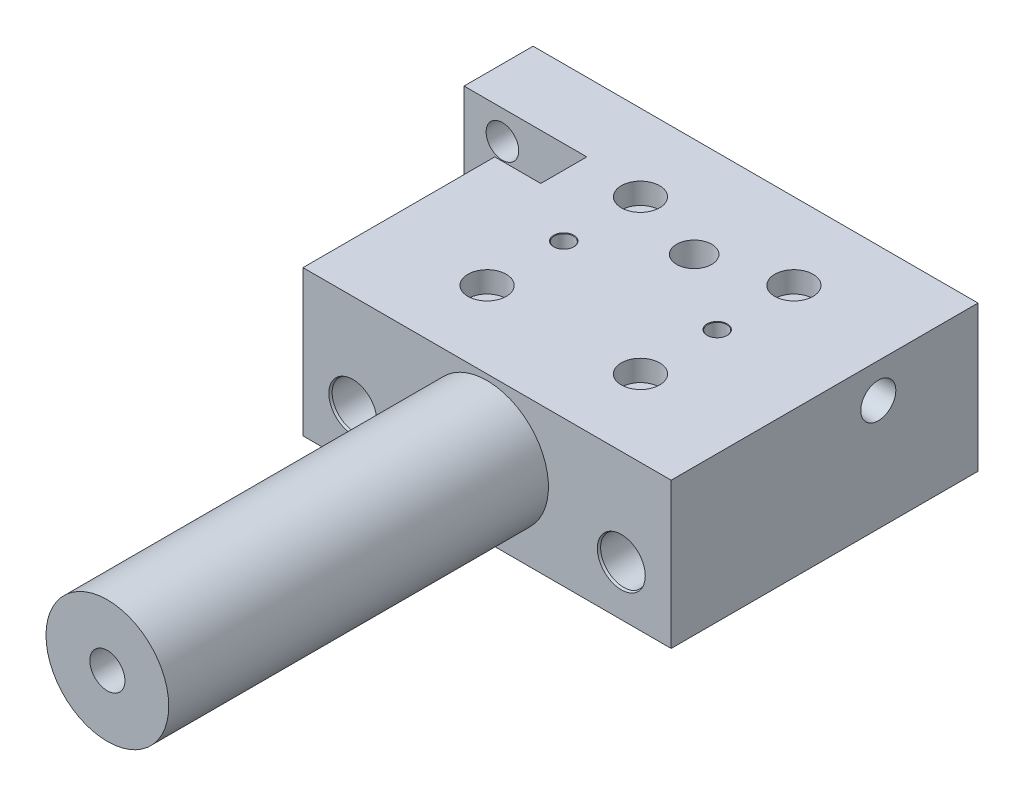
ISO-10303-21;
HEADER;
FILE_DESCRIPTION(('STEP AP214'),'2;1');
FILE_NAME('part.step','',(''),(''),'','','');
FILE_SCHEMA(('AUTOMOTIVE_DESIGN { 1 0 10303 214 1 1 1 1 }'));
ENDSEC;
DATA;
#1=APPLICATION_CONTEXT('core data for automotive mechanical design processes');
#2=APPLICATION_PROTOCOL_DEFINITION('international standard','automotive_design',2000,#1);
#3=PRODUCT_CONTEXT('',#1,'mechanical');
#4=PRODUCT('Part','Part','',(#3));
#5=PRODUCT_RELATED_PRODUCT_CATEGORY('part','',(#4));
#6=PRODUCT_DEFINITION_FORMATION('','',#4);
#7=PRODUCT_DEFINITION_CONTEXT('part definition',#1,'design');
#8=PRODUCT_DEFINITION('design','',#6,#7);
#9=PRODUCT_DEFINITION_SHAPE('','',#8);
#10=(LENGTH_UNIT() NAMED_UNIT(*) SI_UNIT(.MILLI.,.METRE.));
#11=(NAMED_UNIT(*) PLANE_ANGLE_UNIT() SI_UNIT($,.RADIAN.));
#12=(NAMED_UNIT(*) SI_UNIT($,.STERADIAN.) SOLID_ANGLE_UNIT());
#13=UNCERTAINTY_MEASURE_WITH_UNIT(LENGTH_MEASURE(1.E-05),#10,'distance_accuracy_value','');
#14=(GEOMETRIC_REPRESENTATION_CONTEXT(3) GLOBAL_UNCERTAINTY_ASSIGNED_CONTEXT((#13)) GLOBAL_UNIT_ASSIGNED_CONTEXT((#10,
#11,#12)) REPRESENTATION_CONTEXT('',''));
#15=CARTESIAN_POINT('',(0.,0.,0.));
#16=DIRECTION('',(0.,0.,1.));
#17=DIRECTION('',(1.,0.,0.));
#18=AXIS2_PLACEMENT_3D('',#15,#16,#17);
#19=CARTESIAN_POINT('',(0.,4.,-71.));
#20=DIRECTION('',(-1.,0.,0.));
#21=DIRECTION('',(0.,0.,1.));
#22=AXIS2_PLACEMENT_3D('',#19,#20,#21);
#23=CYLINDRICAL_SURFACE('',#22,2.39999999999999);
#24=CARTESIAN_POINT('',(8.99999999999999,4.,-71.));
#25=DIRECTION('',(-1.,0.,0.));
#26=DIRECTION('',(0.,0.,1.));
#27=AXIS2_PLACEMENT_3D('',#24,#25,#26);
#28=CIRCLE('',#27,2.39999999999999);
#29=CARTESIAN_POINT('',(8.99999999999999,4.,-68.6));
#30=VERTEX_POINT('',#29);
#31=EDGE_CURVE('E9355',#30,#30,#28,.T.);
#32=ORIENTED_EDGE('',*,*,#31,.F.);
#33=EDGE_LOOP('',(#32));
#34=FACE_BOUND('',#33,.T.);
#35=CARTESIAN_POINT('',(4.5,4.,-71.));
#36=DIRECTION('',(-1.,0.,0.));
#37=DIRECTION('',(0.,0.,1.));
#38=AXIS2_PLACEMENT_3D('',#35,#36,#37);
#39=CIRCLE('',#38,2.39999999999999);
#40=CARTESIAN_POINT('',(4.5,4.,-68.6));
#41=VERTEX_POINT('',#40);
#42=EDGE_CURVE('E9342',#41,#41,#39,.F.);
#43=ORIENTED_EDGE('',*,*,#42,.F.);
#44=EDGE_LOOP('',(#43));
#45=FACE_BOUND('',#44,.T.);
#46=ADVANCED_FACE('F9174',(#34,#45),#23,.F.);
#47=CARTESIAN_POINT('',(0.,38.,-80.));
#48=DIRECTION('',(1.,0.,0.));
#49=DIRECTION('',(0.,0.,-1.));
#50=AXIS2_PLACEMENT_3D('',#47,#48,#49);
#51=PLANE('',#50);
#52=CARTESIAN_POINT('',(0.,4.,-71.));
#53=DIRECTION('',(-1.,0.,0.));
#54=DIRECTION('',(0.,0.,1.));
#55=AXIS2_PLACEMENT_3D('',#52,#53,#54);
#56=CIRCLE('',#55,4.);
#57=CARTESIAN_POINT('',(0.,3.85832158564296,-67.0025098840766));
#58=VERTEX_POINT('',#57);
#59=CARTESIAN_POINT('',(0.,4.,-75.));
#60=VERTEX_POINT('',#59);
#61=EDGE_CURVE('E9321',#58,#60,#56,.T.);
#62=ORIENTED_EDGE('',*,*,#61,.F.);
#63=DIRECTION('',(0.,1.,0.));
#64=VECTOR('',#63,1.);
#65=CARTESIAN_POINT('',(0.,3.85832158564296,-67.0025098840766));
#66=LINE('',#65,#64);
#67=CARTESIAN_POINT('',(0.,0.,-67.0025098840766));
#68=VERTEX_POINT('',#67);
#69=EDGE_CURVE('E9328',#68,#58,#66,.T.);
#70=ORIENTED_EDGE('',*,*,#69,.F.);
#71=DIRECTION('',(0.,0.,1.));
#72=VECTOR('',#71,1.);
#73=CARTESIAN_POINT('',(0.,0.,-80.));
#74=LINE('',#73,#72);
#75=CARTESIAN_POINT('',(0.,0.,-62.));
#76=VERTEX_POINT('',#75);
#77=EDGE_CURVE('E9548',#68,#76,#74,.T.);
#78=ORIENTED_EDGE('',*,*,#77,.T.);
#79=DIRECTION('',(0.,-1.,0.));
#80=VECTOR('',#79,1.);
#81=CARTESIAN_POINT('',(0.,38.,-62.));
#82=LINE('',#81,#80);
#83=CARTESIAN_POINT('',(0.,38.,-62.));
#84=VERTEX_POINT('',#83);
#85=EDGE_CURVE('E9580',#84,#76,#82,.T.);
#86=ORIENTED_EDGE('',*,*,#85,.F.);
#87=DIRECTION('',(0.,0.,1.));
#88=VECTOR('',#87,1.);
#89=CARTESIAN_POINT('',(0.,38.,-80.));
#90=LINE('',#89,#88);
#91=CARTESIAN_POINT('',(0.,38.,-80.));
#92=VERTEX_POINT('',#91);
#93=EDGE_CURVE('E9565',#92,#84,#90,.T.);
#94=ORIENTED_EDGE('',*,*,#93,.F.);
#95=DIRECTION('',(0.,-1.,0.));
#96=VECTOR('',#95,1.);
#97=CARTESIAN_POINT('',(0.,38.,-80.));
#98=LINE('',#97,#96);
#99=CARTESIAN_POINT('',(0.,0.,-80.));
#100=VERTEX_POINT('',#99);
#101=EDGE_CURVE('E9583',#92,#100,#98,.T.);
#102=ORIENTED_EDGE('',*,*,#101,.T.);
#103=CARTESIAN_POINT('',(0.,0.,-75.));
#104=VERTEX_POINT('',#103);
#105=EDGE_CURVE('E9549',#100,#104,#74,.T.);
#106=ORIENTED_EDGE('',*,*,#105,.T.);
#107=DIRECTION('',(0.,-1.,0.));
#108=VECTOR('',#107,1.);
#109=CARTESIAN_POINT('',(0.,4.,-75.));
#110=LINE('',#109,#108);
#111=EDGE_CURVE('E9326',#60,#104,#110,.T.);
#112=ORIENTED_EDGE('',*,*,#111,.F.);
#113=EDGE_LOOP('',(#62,#70,#78,#86,#94,#102,#106,#112));
#114=FACE_BOUND('',#113,.T.);
#115=ADVANCED_FACE('F9645',(#114),#51,.F.);
#116=CARTESIAN_POINT('',(116.,0.,-80.));
#117=DIRECTION('',(0.,-1.,0.));
#118=DIRECTION('',(0.,0.,-1.));
#119=AXIS2_PLACEMENT_3D('',#116,#117,#118);
#120=PLANE('',#119);
#121=DIRECTION('',(-1.,0.,0.));
#122=VECTOR('',#121,1.);
#123=CARTESIAN_POINT('',(4.5,0.,-67.0025098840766));
#124=LINE('',#123,#122);
#125=CARTESIAN_POINT('',(4.5,0.,-67.0025098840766));
#126=VERTEX_POINT('',#125);
#127=EDGE_CURVE('E9343',#126,#68,#124,.T.);
#128=ORIENTED_EDGE('',*,*,#127,.F.);
#129=DIRECTION('',(0.,0.,1.));
#130=VECTOR('',#129,1.);
#131=CARTESIAN_POINT('',(4.5,0.,-75.));
#132=LINE('',#131,#130);
#133=CARTESIAN_POINT('',(4.5,0.,-75.));
#134=VERTEX_POINT('',#133);
#135=EDGE_CURVE('E9334',#134,#126,#132,.T.);
#136=ORIENTED_EDGE('',*,*,#135,.F.);
#137=DIRECTION('',(-1.,0.,0.));
#138=VECTOR('',#137,1.);
#139=CARTESIAN_POINT('',(4.5,0.,-75.));
#140=LINE('',#139,#138);
#141=EDGE_CURVE('E9345',#134,#104,#140,.T.);
#142=ORIENTED_EDGE('',*,*,#141,.T.);
#143=ORIENTED_EDGE('',*,*,#105,.F.);
#144=DIRECTION('',(-1.,0.,0.));
#145=VECTOR('',#144,1.);
#146=CARTESIAN_POINT('',(0.,0.,-80.));
#147=LINE('',#146,#145);
#148=CARTESIAN_POINT('',(8.99999999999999,0.,-80.));
#149=VERTEX_POINT('',#148);
#150=EDGE_CURVE('E9544',#149,#100,#147,.T.);
#151=ORIENTED_EDGE('',*,*,#150,.F.);
#152=DIRECTION('',(0.,0.,-1.));
#153=VECTOR('',#152,1.);
#154=CARTESIAN_POINT('',(8.99999999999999,0.,-61.));
#155=LINE('',#154,#153);
#156=CARTESIAN_POINT('',(8.99999999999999,0.,-62.));
#157=VERTEX_POINT('',#156);
#158=EDGE_CURVE('E9358',#157,#149,#155,.T.);
#159=ORIENTED_EDGE('',*,*,#158,.F.);
#160=DIRECTION('',(1.,0.,0.));
#161=VECTOR('',#160,1.);
#162=CARTESIAN_POINT('',(0.,0.,-62.));
#163=LINE('',#162,#161);
#164=EDGE_CURVE('E9553',#76,#157,#163,.T.);
#165=ORIENTED_EDGE('',*,*,#164,.F.);
#166=ORIENTED_EDGE('',*,*,#77,.F.);
#167=EDGE_LOOP('',(#128,#136,#142,#143,#151,#159,#165,#166));
#168=FACE_BOUND('',#167,.T.);
#169=ADVANCED_FACE('F9652',(#168),#120,.T.);
#170=CARTESIAN_POINT('',(20.,38.,0.));
#171=DIRECTION('',(0.,0.,-1.));
#172=DIRECTION('',(-1.,0.,0.));
#173=AXIS2_PLACEMENT_3D('',#170,#171,#172);
#174=PLANE('',#173);
#175=DIRECTION('',(1.,0.,0.));
#176=VECTOR('',#175,1.);
#177=CARTESIAN_POINT('',(20.,0.,0.));
#178=LINE('',#177,#176);
#179=CARTESIAN_POINT('',(20.,0.,0.));
#180=VERTEX_POINT('',#179);
#181=CARTESIAN_POINT('',(116.,0.,0.));
#182=VERTEX_POINT('',#181);
#183=EDGE_CURVE('E9558',#180,#182,#178,.T.);
#184=ORIENTED_EDGE('',*,*,#183,.T.);
#185=DIRECTION('',(0.,-1.,0.));
#186=VECTOR('',#185,1.);
#187=CARTESIAN_POINT('',(116.,38.,0.));
#188=LINE('',#187,#186);
#189=CARTESIAN_POINT('',(116.,38.,0.));
#190=VERTEX_POINT('',#189);
#191=EDGE_CURVE('E9572',#190,#182,#188,.T.);
#192=ORIENTED_EDGE('',*,*,#191,.F.);
#193=DIRECTION('',(1.,0.,0.));
#194=VECTOR('',#193,1.);
#195=CARTESIAN_POINT('',(20.,38.,0.));
#196=LINE('',#195,#194);
#197=CARTESIAN_POINT('',(20.,38.,0.));
#198=VERTEX_POINT('',#197);
#199=EDGE_CURVE('E9570',#198,#190,#196,.T.);
#200=ORIENTED_EDGE('',*,*,#199,.F.);
#201=DIRECTION('',(0.,-1.,0.));
#202=VECTOR('',#201,1.);
#203=CARTESIAN_POINT('',(20.,38.,0.));
#204=LINE('',#203,#202);
#205=EDGE_CURVE('E9575',#198,#180,#204,.T.);
#206=ORIENTED_EDGE('',*,*,#205,.T.);
#207=EDGE_LOOP('',(#184,#192,#200,#206));
#208=FACE_BOUND('',#207,.T.);
#209=CARTESIAN_POINT('',(33.,13.,0.));
#210=DIRECTION('',(0.,0.,1.));
#211=DIRECTION('',(1.,0.,0.));
#212=AXIS2_PLACEMENT_3D('',#209,#210,#211);
#213=CIRCLE('',#212,6.25);
#214=CARTESIAN_POINT('',(39.25,13.,0.));
#215=VERTEX_POINT('',#214);
#216=EDGE_CURVE('E9526',#215,#215,#213,.T.);
#217=ORIENTED_EDGE('',*,*,#216,.F.);
#218=EDGE_LOOP('',(#217));
#219=FACE_BOUND('',#218,.T.);
#220=CARTESIAN_POINT('',(103.,13.,0.));
#221=DIRECTION('',(0.,0.,1.));
#222=DIRECTION('',(1.,0.,0.));
#223=AXIS2_PLACEMENT_3D('',#220,#221,#222);
#224=CIRCLE('',#223,6.25000000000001);
#225=CARTESIAN_POINT('',(109.25,13.,0.));
#226=VERTEX_POINT('',#225);
#227=EDGE_CURVE('E9514',#226,#226,#224,.T.);
#228=ORIENTED_EDGE('',*,*,#227,.F.);
#229=EDGE_LOOP('',(#228));
#230=FACE_BOUND('',#229,.T.);
#231=CARTESIAN_POINT('',(68.,20.5,0.));
#232=DIRECTION('',(0.,0.,-1.));
#233=DIRECTION('',(-1.,0.,0.));
#234=AXIS2_PLACEMENT_3D('',#231,#232,#233);
#235=CIRCLE('',#234,16.);
#236=CARTESIAN_POINT('',(52.,20.5,0.));
#237=VERTEX_POINT('',#236);
#238=EDGE_CURVE('E9589',#237,#237,#235,.F.);
#239=ORIENTED_EDGE('',*,*,#238,.F.);
#240=EDGE_LOOP('',(#239));
#241=FACE_BOUND('',#240,.T.);
#242=ADVANCED_FACE('F9626',(#208,#219,#230,#241),#174,.F.);
#243=DIRECTION('',(0.,0.,1.));
#244=VECTOR('',#243,1.);
#245=CARTESIAN_POINT('',(11.,0.,-61.));
#246=LINE('',#245,#244);
#247=CARTESIAN_POINT('',(11.,0.,-80.));
#248=VERTEX_POINT('',#247);
#249=CARTESIAN_POINT('',(11.,0.,-62.));
#250=VERTEX_POINT('',#249);
#251=EDGE_CURVE('E9360',#248,#250,#246,.T.);
#252=ORIENTED_EDGE('',*,*,#251,.F.);
#253=CARTESIAN_POINT('',(116.,0.,-80.));
#254=VERTEX_POINT('',#253);
#255=EDGE_CURVE('E9545',#254,#248,#147,.T.);
#256=ORIENTED_EDGE('',*,*,#255,.F.);
#257=DIRECTION('',(0.,0.,-1.));
#258=VECTOR('',#257,1.);
#259=CARTESIAN_POINT('',(116.,0.,0.));
#260=LINE('',#259,#258);
#261=EDGE_CURVE('E9541',#182,#254,#260,.T.);
#262=ORIENTED_EDGE('',*,*,#261,.F.);
#263=ORIENTED_EDGE('',*,*,#183,.F.);
#264=DIRECTION('',(0.,0.,1.));
#265=VECTOR('',#264,1.);
#266=CARTESIAN_POINT('',(20.,0.,-62.));
#267=LINE('',#266,#265);
#268=CARTESIAN_POINT('',(20.,0.,-62.));
#269=VERTEX_POINT('',#268);
#270=EDGE_CURVE('E9556',#269,#180,#267,.T.);
#271=ORIENTED_EDGE('',*,*,#270,.F.);
#272=EDGE_CURVE('E9552',#250,#269,#163,.T.);
#273=ORIENTED_EDGE('',*,*,#272,.F.);
#274=EDGE_LOOP('',(#252,#256,#262,#263,#271,#273));
#275=FACE_BOUND('',#274,.T.);
#276=CARTESIAN_POINT('',(68.,0.,-54.));
#277=DIRECTION('',(0.,-1.,0.));
#278=DIRECTION('',(0.,0.,-1.));
#279=AXIS2_PLACEMENT_3D('',#276,#277,#278);
#280=CIRCLE('',#279,4.57349999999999);
#281=CARTESIAN_POINT('',(68.,0.,-58.5735));
#282=VERTEX_POINT('',#281);
#283=EDGE_CURVE('E9422',#282,#282,#280,.T.);
#284=ORIENTED_EDGE('',*,*,#283,.F.);
#285=EDGE_LOOP('',(#284));
#286=FACE_BOUND('',#285,.T.);
#287=CARTESIAN_POINT('',(48.,0.,-20.));
#288=DIRECTION('',(0.,-1.,0.));
#289=DIRECTION('',(0.,0.,-1.));
#290=AXIS2_PLACEMENT_3D('',#287,#288,#289);
#291=CIRCLE('',#290,5.);
#292=CARTESIAN_POINT('',(48.,0.,-25.));
#293=VERTEX_POINT('',#292);
#294=EDGE_CURVE('E9425',#293,#293,#291,.T.);
#295=ORIENTED_EDGE('',*,*,#294,.F.);
#296=EDGE_LOOP('',(#295));
#297=FACE_BOUND('',#296,.T.);
#298=CARTESIAN_POINT('',(48.,0.,-60.));
#299=DIRECTION('',(0.,-1.,0.));
#300=DIRECTION('',(0.,0.,-1.));
#301=AXIS2_PLACEMENT_3D('',#298,#299,#300);
#302=CIRCLE('',#301,5.);
#303=CARTESIAN_POINT('',(48.,0.,-65.));
#304=VERTEX_POINT('',#303);
#305=EDGE_CURVE('E9453',#304,#304,#302,.T.);
#306=ORIENTED_EDGE('',*,*,#305,.F.);
#307=EDGE_LOOP('',(#306));
#308=FACE_BOUND('',#307,.T.);
#309=CARTESIAN_POINT('',(88.,0.,-40.));
#310=DIRECTION('',(0.,-1.,0.));
#311=DIRECTION('',(0.,0.,-1.));
#312=AXIS2_PLACEMENT_3D('',#309,#310,#311);
#313=CIRCLE('',#312,2.625);
#314=CARTESIAN_POINT('',(88.,0.,-42.625));
#315=VERTEX_POINT('',#314);
#316=EDGE_CURVE('E9490',#315,#315,#313,.T.);
#317=ORIENTED_EDGE('',*,*,#316,.F.);
#318=EDGE_LOOP('',(#317));
#319=FACE_BOUND('',#318,.T.);
#320=CARTESIAN_POINT('',(48.,0.,-40.));
#321=DIRECTION('',(0.,-1.,0.));
#322=DIRECTION('',(0.,0.,-1.));
#323=AXIS2_PLACEMENT_3D('',#320,#321,#322);
#324=CIRCLE('',#323,2.625);
#325=CARTESIAN_POINT('',(48.,0.,-42.625));
#326=VERTEX_POINT('',#325);
#327=EDGE_CURVE('E9502',#326,#326,#324,.T.);
#328=ORIENTED_EDGE('',*,*,#327,.F.);
#329=EDGE_LOOP('',(#328));
#330=FACE_BOUND('',#329,.T.);
#331=CARTESIAN_POINT('',(88.,0.,-60.));
#332=DIRECTION('',(0.,-1.,0.));
#333=DIRECTION('',(0.,0.,-1.));
#334=AXIS2_PLACEMENT_3D('',#331,#332,#333);
#335=CIRCLE('',#334,5.);
#336=CARTESIAN_POINT('',(88.,0.,-65.));
#337=VERTEX_POINT('',#336);
#338=EDGE_CURVE('E9467',#337,#337,#335,.T.);
#339=ORIENTED_EDGE('',*,*,#338,.F.);
#340=EDGE_LOOP('',(#339));
#341=FACE_BOUND('',#340,.T.);
#342=CARTESIAN_POINT('',(88.,0.,-20.));
#343=DIRECTION('',(0.,-1.,0.));
#344=DIRECTION('',(0.,0.,-1.));
#345=AXIS2_PLACEMENT_3D('',#342,#343,#344);
#346=CIRCLE('',#345,5.);
#347=CARTESIAN_POINT('',(88.,0.,-25.));
#348=VERTEX_POINT('',#347);
#349=EDGE_CURVE('E9439',#348,#348,#346,.T.);
#350=ORIENTED_EDGE('',*,*,#349,.F.);
#351=EDGE_LOOP('',(#350));
#352=FACE_BOUND('',#351,.T.);
#353=ADVANCED_FACE('F9631',(#275,#286,#297,#308,#319,#330,#341,#352),#120,.T.);
#354=CARTESIAN_POINT('',(116.,38.,0.));
#355=DIRECTION('',(-1.,0.,0.));
#356=DIRECTION('',(0.,0.,1.));
#357=AXIS2_PLACEMENT_3D('',#354,#355,#356);
#358=PLANE('',#357);
#359=CARTESIAN_POINT('',(116.,29.,-54.));
#360=DIRECTION('',(1.,0.,0.));
#361=DIRECTION('',(0.,0.,-1.));
#362=AXIS2_PLACEMENT_3D('',#359,#360,#361);
#363=CIRCLE('',#362,4.5735);
#364=CARTESIAN_POINT('',(116.,29.,-58.5735));
#365=VERTEX_POINT('',#364);
#366=EDGE_CURVE('E9398',#365,#365,#363,.T.);
#367=ORIENTED_EDGE('',*,*,#366,.F.);
#368=EDGE_LOOP('',(#367));
#369=FACE_BOUND('',#368,.T.);
#370=ORIENTED_EDGE('',*,*,#261,.T.);
#371=DIRECTION('',(0.,-1.,0.));
#372=VECTOR('',#371,1.);
#373=CARTESIAN_POINT('',(116.,38.,-80.));
#374=LINE('',#373,#372);
#375=CARTESIAN_POINT('',(116.,38.,-80.));
#376=VERTEX_POINT('',#375);
#377=EDGE_CURVE('E9586',#376,#254,#374,.T.);
#378=ORIENTED_EDGE('',*,*,#377,.F.);
#379=DIRECTION('',(0.,0.,-1.));
#380=VECTOR('',#379,1.);
#381=CARTESIAN_POINT('',(116.,38.,0.));
#382=LINE('',#381,#380);
#383=EDGE_CURVE('E9560',#190,#376,#382,.T.);
#384=ORIENTED_EDGE('',*,*,#383,.F.);
#385=ORIENTED_EDGE('',*,*,#191,.T.);
#386=EDGE_LOOP('',(#370,#378,#384,#385));
#387=FACE_BOUND('',#386,.T.);
#388=ADVANCED_FACE('F9176',(#369,#387),#358,.F.);
#389=CARTESIAN_POINT('',(0.,38.,-80.));
#390=DIRECTION('',(0.,0.,1.));
#391=DIRECTION('',(1.,0.,0.));
#392=AXIS2_PLACEMENT_3D('',#389,#390,#391);
#393=PLANE('',#392);
#394=CARTESIAN_POINT('',(103.,13.,-80.));
#395=DIRECTION('',(0.,0.,1.));
#396=DIRECTION('',(1.,0.,0.));
#397=AXIS2_PLACEMENT_3D('',#394,#395,#396);
#398=CIRCLE('',#397,6.24999999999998);
#399=CARTESIAN_POINT('',(109.25,13.,-80.));
#400=VERTEX_POINT('',#399);
#401=EDGE_CURVE('E9505',#400,#400,#398,.T.);
#402=ORIENTED_EDGE('',*,*,#401,.T.);
#403=EDGE_LOOP('',(#402));
#404=FACE_BOUND('',#403,.T.);
#405=CARTESIAN_POINT('',(33.,13.,-80.));
#406=DIRECTION('',(0.,0.,1.));
#407=DIRECTION('',(1.,0.,0.));
#408=AXIS2_PLACEMENT_3D('',#405,#406,#407);
#409=CIRCLE('',#408,6.24999999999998);
#410=CARTESIAN_POINT('',(39.25,13.,-80.));
#411=VERTEX_POINT('',#410);
#412=EDGE_CURVE('E9517',#411,#411,#409,.T.);
#413=ORIENTED_EDGE('',*,*,#412,.T.);
#414=EDGE_LOOP('',(#413));
#415=FACE_BOUND('',#414,.T.);
#416=CARTESIAN_POINT('',(9.99999999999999,30.5,-80.));
#417=DIRECTION('',(0.,0.,1.));
#418=DIRECTION('',(1.,0.,0.));
#419=AXIS2_PLACEMENT_3D('',#416,#417,#418);
#420=CIRCLE('',#419,4.24999999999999);
#421=CARTESIAN_POINT('',(14.25,30.5,-80.));
#422=VERTEX_POINT('',#421);
#423=EDGE_CURVE('E9529',#422,#422,#420,.T.);
#424=ORIENTED_EDGE('',*,*,#423,.T.);
#425=EDGE_LOOP('',(#424));
#426=FACE_BOUND('',#425,.T.);
#427=CARTESIAN_POINT('',(9.99999999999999,13.5,-80.));
#428=DIRECTION('',(0.,0.,1.));
#429=DIRECTION('',(1.,0.,0.));
#430=AXIS2_PLACEMENT_3D('',#427,#428,#429);
#431=CIRCLE('',#430,6.);
#432=CARTESIAN_POINT('',(11.,7.58392021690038,-80.));
#433=VERTEX_POINT('',#432);
#434=CARTESIAN_POINT('',(8.99999999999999,7.58392021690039,-80.));
#435=VERTEX_POINT('',#434);
#436=EDGE_CURVE('E9535',#433,#435,#431,.T.);
#437=ORIENTED_EDGE('',*,*,#436,.T.);
#438=DIRECTION('',(0.,-1.,0.));
#439=VECTOR('',#438,1.);
#440=CARTESIAN_POINT('',(8.99999999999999,38.,-80.));
#441=LINE('',#440,#439);
#442=EDGE_CURVE('E9371',#435,#149,#441,.T.);
#443=ORIENTED_EDGE('',*,*,#442,.T.);
#444=ORIENTED_EDGE('',*,*,#150,.T.);
#445=ORIENTED_EDGE('',*,*,#101,.F.);
#446=DIRECTION('',(-1.,0.,0.));
#447=VECTOR('',#446,1.);
#448=CARTESIAN_POINT('',(0.,38.,-80.));
#449=LINE('',#448,#447);
#450=EDGE_CURVE('E9563',#376,#92,#449,.T.);
#451=ORIENTED_EDGE('',*,*,#450,.F.);
#452=ORIENTED_EDGE('',*,*,#377,.T.);
#453=ORIENTED_EDGE('',*,*,#255,.T.);
#454=DIRECTION('',(0.,1.,0.));
#455=VECTOR('',#454,1.);
#456=CARTESIAN_POINT('',(11.,38.,-80.));
#457=LINE('',#456,#455);
#458=EDGE_CURVE('E9365',#248,#433,#457,.T.);
#459=ORIENTED_EDGE('',*,*,#458,.T.);
#460=EDGE_LOOP('',(#437,#443,#444,#445,#451,#452,#453,#459));
#461=FACE_BOUND('',#460,.T.);
#462=ADVANCED_FACE('F9640',(#404,#415,#426,#461),#393,.F.);
#463=CARTESIAN_POINT('',(0.,38.,-62.));
#464=DIRECTION('',(0.,0.,-1.));
#465=DIRECTION('',(-1.,0.,0.));
#466=AXIS2_PLACEMENT_3D('',#463,#464,#465);
#467=PLANE('',#466);
#468=CARTESIAN_POINT('',(9.99999999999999,30.5,-62.));
#469=DIRECTION('',(0.,0.,1.));
#470=DIRECTION('',(1.,0.,0.));
#471=AXIS2_PLACEMENT_3D('',#468,#469,#470);
#472=CIRCLE('',#471,4.24999999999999);
#473=CARTESIAN_POINT('',(14.25,30.5,-62.));
#474=VERTEX_POINT('',#473);
#475=EDGE_CURVE('E9532',#474,#474,#472,.T.);
#476=ORIENTED_EDGE('',*,*,#475,.F.);
#477=EDGE_LOOP('',(#476));
#478=FACE_BOUND('',#477,.T.);
#479=DIRECTION('',(0.,-1.,0.));
#480=VECTOR('',#479,1.);
#481=CARTESIAN_POINT('',(20.,38.,-62.));
#482=LINE('',#481,#480);
#483=CARTESIAN_POINT('',(20.,26.,-62.));
#484=VERTEX_POINT('',#483);
#485=EDGE_CURVE('E9578',#484,#269,#482,.T.);
#486=ORIENTED_EDGE('',*,*,#485,.F.);
#487=DIRECTION('',(-0.707106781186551,-0.707106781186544,0.));
#488=VECTOR('',#487,1.);
#489=CARTESIAN_POINT('',(19.9999999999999,26.,-62.));
#490=LINE('',#489,#488);
#491=CARTESIAN_POINT('',(32.,38.,-62.));
#492=VERTEX_POINT('',#491);
#493=EDGE_CURVE('E9182',#484,#492,#490,.F.);
#494=ORIENTED_EDGE('',*,*,#493,.T.);
#495=DIRECTION('',(1.,0.,0.));
#496=VECTOR('',#495,1.);
#497=CARTESIAN_POINT('',(0.,38.,-62.));
#498=LINE('',#497,#496);
#499=EDGE_CURVE('E9311',#84,#492,#498,.T.);
#500=ORIENTED_EDGE('',*,*,#499,.F.);
#501=ORIENTED_EDGE('',*,*,#85,.T.);
#502=ORIENTED_EDGE('',*,*,#164,.T.);
#503=DIRECTION('',(0.,1.,0.));
#504=VECTOR('',#503,1.);
#505=CARTESIAN_POINT('',(8.99999999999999,38.,-62.));
#506=LINE('',#505,#504);
#507=CARTESIAN_POINT('',(8.99999999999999,7.58392021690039,-62.));
#508=VERTEX_POINT('',#507);
#509=EDGE_CURVE('E9368',#157,#508,#506,.T.);
#510=ORIENTED_EDGE('',*,*,#509,.T.);
#511=CARTESIAN_POINT('',(9.99999999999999,13.5,-62.));
#512=DIRECTION('',(0.,0.,1.));
#513=DIRECTION('',(1.,0.,0.));
#514=AXIS2_PLACEMENT_3D('',#511,#512,#513);
#515=CIRCLE('',#514,6.);
#516=CARTESIAN_POINT('',(11.,7.58392021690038,-62.));
#517=VERTEX_POINT('',#516);
#518=EDGE_CURVE('E9538',#517,#508,#515,.T.);
#519=ORIENTED_EDGE('',*,*,#518,.F.);
#520=DIRECTION('',(0.,-1.,0.));
#521=VECTOR('',#520,1.);
#522=CARTESIAN_POINT('',(11.,38.,-62.));
#523=LINE('',#522,#521);
#524=EDGE_CURVE('E9362',#517,#250,#523,.T.);
#525=ORIENTED_EDGE('',*,*,#524,.T.);
#526=ORIENTED_EDGE('',*,*,#272,.T.);
#527=EDGE_LOOP('',(#486,#494,#500,#501,#502,#510,#519,#525,#526));
#528=FACE_BOUND('',#527,.T.);
#529=ADVANCED_FACE('F9616',(#478,#528),#467,.F.);
#530=CARTESIAN_POINT('',(20.,38.,-62.));
#531=DIRECTION('',(1.,0.,0.));
#532=DIRECTION('',(0.,0.,-1.));
#533=AXIS2_PLACEMENT_3D('',#530,#531,#532);
#534=PLANE('',#533);
#535=DIRECTION('',(0.,0.,1.));
#536=VECTOR('',#535,1.);
#537=CARTESIAN_POINT('',(20.,38.,-62.));
#538=LINE('',#537,#536);
#539=CARTESIAN_POINT('',(20.,38.,-50.));
#540=VERTEX_POINT('',#539);
#541=EDGE_CURVE('E9568',#540,#198,#538,.T.);
#542=ORIENTED_EDGE('',*,*,#541,.F.);
#543=DIRECTION('',(0.,1.,0.));
#544=VECTOR('',#543,1.);
#545=CARTESIAN_POINT('',(20.,26.,-50.));
#546=LINE('',#545,#544);
#547=CARTESIAN_POINT('',(20.,26.,-50.));
#548=VERTEX_POINT('',#547);
#549=EDGE_CURVE('E9188',#548,#540,#546,.T.);
#550=ORIENTED_EDGE('',*,*,#549,.F.);
#551=DIRECTION('',(0.,0.,1.));
#552=VECTOR('',#551,1.);
#553=CARTESIAN_POINT('',(20.,26.,-50.));
#554=LINE('',#553,#552);
#555=EDGE_CURVE('E9313',#484,#548,#554,.T.);
#556=ORIENTED_EDGE('',*,*,#555,.F.);
#557=ORIENTED_EDGE('',*,*,#485,.T.);
#558=ORIENTED_EDGE('',*,*,#270,.T.);
#559=ORIENTED_EDGE('',*,*,#205,.F.);
#560=EDGE_LOOP('',(#542,#550,#556,#557,#558,#559));
#561=FACE_BOUND('',#560,.T.);
#562=ADVANCED_FACE('F9620',(#561),#534,.F.);
#563=CARTESIAN_POINT('',(116.,38.,-80.));
#564=DIRECTION('',(0.,-1.,0.));
#565=DIRECTION('',(0.,0.,-1.));
#566=AXIS2_PLACEMENT_3D('',#563,#564,#565);
#567=PLANE('',#566);
#568=CARTESIAN_POINT('',(68.,38.,-54.));
#569=DIRECTION('',(0.,1.,0.));
#570=DIRECTION('',(0.,0.,1.));
#571=AXIS2_PLACEMENT_3D('',#568,#569,#570);
#572=CIRCLE('',#571,4.57349999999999);
#573=CARTESIAN_POINT('',(68.,38.,-49.4265));
#574=VERTEX_POINT('',#573);
#575=EDGE_CURVE('E9401',#574,#574,#572,.T.);
#576=ORIENTED_EDGE('',*,*,#575,.F.);
#577=EDGE_LOOP('',(#576));
#578=FACE_BOUND('',#577,.T.);
#579=CARTESIAN_POINT('',(48.,38.,-20.));
#580=DIRECTION('',(0.,1.,0.));
#581=DIRECTION('',(0.,0.,1.));
#582=AXIS2_PLACEMENT_3D('',#579,#580,#581);
#583=CIRCLE('',#582,5.);
#584=CARTESIAN_POINT('',(48.,38.,-15.));
#585=VERTEX_POINT('',#584);
#586=EDGE_CURVE('E9432',#585,#585,#583,.T.);
#587=ORIENTED_EDGE('',*,*,#586,.F.);
#588=EDGE_LOOP('',(#587));
#589=FACE_BOUND('',#588,.T.);
#590=CARTESIAN_POINT('',(88.,38.,-20.));
#591=DIRECTION('',(0.,1.,0.));
#592=DIRECTION('',(0.,0.,1.));
#593=AXIS2_PLACEMENT_3D('',#590,#591,#592);
#594=CIRCLE('',#593,5.);
#595=CARTESIAN_POINT('',(88.,38.,-15.));
#596=VERTEX_POINT('',#595);
#597=EDGE_CURVE('E9446',#596,#596,#594,.T.);
#598=ORIENTED_EDGE('',*,*,#597,.F.);
#599=EDGE_LOOP('',(#598));
#600=FACE_BOUND('',#599,.T.);
#601=CARTESIAN_POINT('',(48.,38.,-60.));
#602=DIRECTION('',(0.,1.,0.));
#603=DIRECTION('',(0.,0.,1.));
#604=AXIS2_PLACEMENT_3D('',#601,#602,#603);
#605=CIRCLE('',#604,5.);
#606=CARTESIAN_POINT('',(48.,38.,-55.));
#607=VERTEX_POINT('',#606);
#608=EDGE_CURVE('E9460',#607,#607,#605,.T.);
#609=ORIENTED_EDGE('',*,*,#608,.F.);
#610=EDGE_LOOP('',(#609));
#611=FACE_BOUND('',#610,.T.);
#612=CARTESIAN_POINT('',(88.,38.,-60.));
#613=DIRECTION('',(0.,1.,0.));
#614=DIRECTION('',(0.,0.,1.));
#615=AXIS2_PLACEMENT_3D('',#612,#613,#614);
#616=CIRCLE('',#615,5.);
#617=CARTESIAN_POINT('',(88.,38.,-55.));
#618=VERTEX_POINT('',#617);
#619=EDGE_CURVE('E9477',#618,#618,#616,.T.);
#620=ORIENTED_EDGE('',*,*,#619,.F.);
#621=EDGE_LOOP('',(#620));
#622=FACE_BOUND('',#621,.T.);
#623=CARTESIAN_POINT('',(88.,38.,-40.));
#624=DIRECTION('',(0.,-1.,0.));
#625=DIRECTION('',(0.,0.,-1.));
#626=AXIS2_PLACEMENT_3D('',#623,#624,#625);
#627=CIRCLE('',#626,2.62499999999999);
#628=CARTESIAN_POINT('',(88.,38.,-42.625));
#629=VERTEX_POINT('',#628);
#630=EDGE_CURVE('E9481',#629,#629,#627,.T.);
#631=ORIENTED_EDGE('',*,*,#630,.T.);
#632=EDGE_LOOP('',(#631));
#633=FACE_BOUND('',#632,.T.);
#634=CARTESIAN_POINT('',(48.,38.,-40.));
#635=DIRECTION('',(0.,-1.,0.));
#636=DIRECTION('',(0.,0.,-1.));
#637=AXIS2_PLACEMENT_3D('',#634,#635,#636);
#638=CIRCLE('',#637,2.62499999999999);
#639=CARTESIAN_POINT('',(48.,38.,-42.625));
#640=VERTEX_POINT('',#639);
#641=EDGE_CURVE('E9493',#640,#640,#638,.T.);
#642=ORIENTED_EDGE('',*,*,#641,.T.);
#643=EDGE_LOOP('',(#642));
#644=FACE_BOUND('',#643,.T.);
#645=ORIENTED_EDGE('',*,*,#499,.T.);
#646=DIRECTION('',(0.,0.,-1.));
#647=VECTOR('',#646,1.);
#648=CARTESIAN_POINT('',(32.,38.,-62.));
#649=LINE('',#648,#647);
#650=CARTESIAN_POINT('',(32.,38.,-50.));
#651=VERTEX_POINT('',#650);
#652=EDGE_CURVE('E9305',#651,#492,#649,.T.);
#653=ORIENTED_EDGE('',*,*,#652,.F.);
#654=DIRECTION('',(1.,0.,0.));
#655=VECTOR('',#654,1.);
#656=CARTESIAN_POINT('',(32.,38.,-50.));
#657=LINE('',#656,#655);
#658=EDGE_CURVE('E9299',#540,#651,#657,.T.);
#659=ORIENTED_EDGE('',*,*,#658,.F.);
#660=ORIENTED_EDGE('',*,*,#541,.T.);
#661=ORIENTED_EDGE('',*,*,#199,.T.);
#662=ORIENTED_EDGE('',*,*,#383,.T.);
#663=ORIENTED_EDGE('',*,*,#450,.T.);
#664=ORIENTED_EDGE('',*,*,#93,.T.);
#665=EDGE_LOOP('',(#645,#653,#659,#660,#661,#662,#663,#664));
#666=FACE_BOUND('',#665,.T.);
#667=ADVANCED_FACE('F9309',(#578,#589,#600,#611,#622,#633,#644,#666),#567,.F.);
#668=CARTESIAN_POINT('',(9.99999999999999,13.5,-62.));
#669=DIRECTION('',(0.,0.,1.));
#670=DIRECTION('',(1.,0.,0.));
#671=AXIS2_PLACEMENT_3D('',#668,#669,#670);
#672=CYLINDRICAL_SURFACE('',#671,6.);
#673=ORIENTED_EDGE('',*,*,#518,.T.);
#674=DIRECTION('',(0.,0.,1.));
#675=VECTOR('',#674,1.);
#676=CARTESIAN_POINT('',(8.99999999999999,7.58392021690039,-62.));
#677=LINE('',#676,#675);
#678=EDGE_CURVE('E9611',#508,#435,#677,.F.);
#679=ORIENTED_EDGE('',*,*,#678,.T.);
#680=ORIENTED_EDGE('',*,*,#436,.F.);
#681=DIRECTION('',(0.,0.,1.));
#682=VECTOR('',#681,1.);
#683=CARTESIAN_POINT('',(11.,7.58392021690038,-62.));
#684=LINE('',#683,#682);
#685=EDGE_CURVE('E9608',#433,#517,#684,.T.);
#686=ORIENTED_EDGE('',*,*,#685,.T.);
#687=EDGE_LOOP('',(#673,#679,#680,#686));
#688=FACE_BOUND('',#687,.T.);
#689=ADVANCED_FACE('F9657',(#688),#672,.F.);
#690=CARTESIAN_POINT('',(9.99999999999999,30.5,-62.));
#691=DIRECTION('',(0.,0.,1.));
#692=DIRECTION('',(1.,0.,0.));
#693=AXIS2_PLACEMENT_3D('',#690,#691,#692);
#694=CYLINDRICAL_SURFACE('',#693,4.24999999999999);
#695=ORIENTED_EDGE('',*,*,#423,.F.);
#696=EDGE_LOOP('',(#695));
#697=FACE_BOUND('',#696,.T.);
#698=ORIENTED_EDGE('',*,*,#475,.T.);
#699=EDGE_LOOP('',(#698));
#700=FACE_BOUND('',#699,.T.);
#701=ADVANCED_FACE('F9789',(#697,#700),#694,.F.);
#702=CARTESIAN_POINT('',(33.,13.,0.));
#703=DIRECTION('',(0.,0.,1.));
#704=DIRECTION('',(1.,0.,0.));
#705=AXIS2_PLACEMENT_3D('',#702,#703,#704);
#706=CONICAL_SURFACE('',#705,6.25,0.392699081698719);
#707=CARTESIAN_POINT('',(33.,13.,-0.6035533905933));
#708=DIRECTION('',(0.,0.,1.));
#709=DIRECTION('',(1.,0.,0.));
#710=AXIS2_PLACEMENT_3D('',#707,#708,#709);
#711=CIRCLE('',#710,5.99999999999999);
#712=CARTESIAN_POINT('',(39.,13.,-0.6035533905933));
#713=VERTEX_POINT('',#712);
#714=EDGE_CURVE('E9523',#713,#713,#711,.T.);
#715=ORIENTED_EDGE('',*,*,#714,.F.);
#716=EDGE_LOOP('',(#715));
#717=FACE_BOUND('',#716,.T.);
#718=ORIENTED_EDGE('',*,*,#216,.T.);
#719=EDGE_LOOP('',(#718));
#720=FACE_BOUND('',#719,.T.);
#721=ADVANCED_FACE('F10199',(#717,#720),#706,.F.);
#722=CARTESIAN_POINT('',(33.,13.,0.));
#723=DIRECTION('',(0.,0.,1.));
#724=DIRECTION('',(1.,0.,0.));
#725=AXIS2_PLACEMENT_3D('',#722,#723,#724);
#726=CYLINDRICAL_SURFACE('',#725,5.99999999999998);
#727=CARTESIAN_POINT('',(33.,13.,-79.3964466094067));
#728=DIRECTION('',(0.,0.,1.));
#729=DIRECTION('',(1.,0.,0.));
#730=AXIS2_PLACEMENT_3D('',#727,#728,#729);
#731=CIRCLE('',#730,5.99999999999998);
#732=CARTESIAN_POINT('',(39.,13.,-79.3964466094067));
#733=VERTEX_POINT('',#732);
#734=EDGE_CURVE('E9520',#733,#733,#731,.T.);
#735=ORIENTED_EDGE('',*,*,#734,.F.);
#736=EDGE_LOOP('',(#735));
#737=FACE_BOUND('',#736,.T.);
#738=ORIENTED_EDGE('',*,*,#714,.T.);
#739=EDGE_LOOP('',(#738));
#740=FACE_BOUND('',#739,.T.);
#741=ADVANCED_FACE('F10191',(#737,#740),#726,.F.);
#742=CARTESIAN_POINT('',(33.,13.,-79.3964466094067));
#743=DIRECTION('',(0.,0.,-1.));
#744=DIRECTION('',(-1.,0.,0.));
#745=AXIS2_PLACEMENT_3D('',#742,#743,#744);
#746=CONICAL_SURFACE('',#745,5.99999999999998,0.392699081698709);
#747=ORIENTED_EDGE('',*,*,#412,.F.);
#748=EDGE_LOOP('',(#747));
#749=FACE_BOUND('',#748,.T.);
#750=ORIENTED_EDGE('',*,*,#734,.T.);
#751=EDGE_LOOP('',(#750));
#752=FACE_BOUND('',#751,.T.);
#753=ADVANCED_FACE('F10183',(#749,#752),#746,.F.);
#754=CARTESIAN_POINT('',(103.,13.,0.));
#755=DIRECTION('',(0.,0.,1.));
#756=DIRECTION('',(1.,0.,0.));
#757=AXIS2_PLACEMENT_3D('',#754,#755,#756);
#758=CONICAL_SURFACE('',#757,6.25000000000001,0.392699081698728);
#759=CARTESIAN_POINT('',(103.,13.,-0.6035533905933));
#760=DIRECTION('',(0.,0.,1.));
#761=DIRECTION('',(1.,0.,0.));
#762=AXIS2_PLACEMENT_3D('',#759,#760,#761);
#763=CIRCLE('',#762,5.99999999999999);
#764=CARTESIAN_POINT('',(109.,13.,-0.6035533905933));
#765=VERTEX_POINT('',#764);
#766=EDGE_CURVE('E9511',#765,#765,#763,.T.);
#767=ORIENTED_EDGE('',*,*,#766,.F.);
#768=EDGE_LOOP('',(#767));
#769=FACE_BOUND('',#768,.T.);
#770=ORIENTED_EDGE('',*,*,#227,.T.);
#771=EDGE_LOOP('',(#770));
#772=FACE_BOUND('',#771,.T.);
#773=ADVANCED_FACE('F10175',(#769,#772),#758,.F.);
#774=CARTESIAN_POINT('',(103.,13.,0.));
#775=DIRECTION('',(0.,0.,1.));
#776=DIRECTION('',(1.,0.,0.));
#777=AXIS2_PLACEMENT_3D('',#774,#775,#776);
#778=CYLINDRICAL_SURFACE('',#777,5.99999999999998);
#779=CARTESIAN_POINT('',(103.,13.,-79.3964466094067));
#780=DIRECTION('',(0.,0.,1.));
#781=DIRECTION('',(1.,0.,0.));
#782=AXIS2_PLACEMENT_3D('',#779,#780,#781);
#783=CIRCLE('',#782,5.99999999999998);
#784=CARTESIAN_POINT('',(109.,13.,-79.3964466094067));
#785=VERTEX_POINT('',#784);
#786=EDGE_CURVE('E9508',#785,#785,#783,.T.);
#787=ORIENTED_EDGE('',*,*,#786,.F.);
#788=EDGE_LOOP('',(#787));
#789=FACE_BOUND('',#788,.T.);
#790=ORIENTED_EDGE('',*,*,#766,.T.);
#791=EDGE_LOOP('',(#790));
#792=FACE_BOUND('',#791,.T.);
#793=ADVANCED_FACE('F10167',(#789,#792),#778,.F.);
#794=CARTESIAN_POINT('',(103.,13.,-79.3964466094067));
#795=DIRECTION('',(0.,0.,-1.));
#796=DIRECTION('',(-1.,0.,0.));
#797=AXIS2_PLACEMENT_3D('',#794,#795,#796);
#798=CONICAL_SURFACE('',#797,5.99999999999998,0.392699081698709);
#799=ORIENTED_EDGE('',*,*,#401,.F.);
#800=EDGE_LOOP('',(#799));
#801=FACE_BOUND('',#800,.T.);
#802=ORIENTED_EDGE('',*,*,#786,.T.);
#803=EDGE_LOOP('',(#802));
#804=FACE_BOUND('',#803,.T.);
#805=ADVANCED_FACE('F10159',(#801,#804),#798,.F.);
#806=CARTESIAN_POINT('',(48.,0.,-40.));
#807=DIRECTION('',(0.,-1.,0.));
#808=DIRECTION('',(0.,0.,-1.));
#809=AXIS2_PLACEMENT_3D('',#806,#807,#808);
#810=CONICAL_SURFACE('',#809,2.625,0.785398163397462);
#811=CARTESIAN_POINT('',(48.,0.125000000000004,-40.));
#812=DIRECTION('',(0.,-1.,0.));
#813=DIRECTION('',(0.,0.,-1.));
#814=AXIS2_PLACEMENT_3D('',#811,#812,#813);
#815=CIRCLE('',#814,2.5);
#816=CARTESIAN_POINT('',(48.,0.125000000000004,-42.5));
#817=VERTEX_POINT('',#816);
#818=EDGE_CURVE('E9499',#817,#817,#815,.T.);
#819=ORIENTED_EDGE('',*,*,#818,.F.);
#820=EDGE_LOOP('',(#819));
#821=FACE_BOUND('',#820,.T.);
#822=ORIENTED_EDGE('',*,*,#327,.T.);
#823=EDGE_LOOP('',(#822));
#824=FACE_BOUND('',#823,.T.);
#825=ADVANCED_FACE('F10151',(#821,#824),#810,.F.);
#826=CARTESIAN_POINT('',(48.,0.,-40.));
#827=DIRECTION('',(0.,-1.,0.));
#828=DIRECTION('',(0.,0.,-1.));
#829=AXIS2_PLACEMENT_3D('',#826,#827,#828);
#830=CYLINDRICAL_SURFACE('',#829,2.5);
#831=CARTESIAN_POINT('',(48.,37.875,-40.));
#832=DIRECTION('',(0.,-1.,0.));
#833=DIRECTION('',(0.,0.,-1.));
#834=AXIS2_PLACEMENT_3D('',#831,#832,#833);
#835=CIRCLE('',#834,2.5);
#836=CARTESIAN_POINT('',(48.,37.875,-42.5));
#837=VERTEX_POINT('',#836);
#838=EDGE_CURVE('E9496',#837,#837,#835,.T.);
#839=ORIENTED_EDGE('',*,*,#838,.F.);
#840=EDGE_LOOP('',(#839));
#841=FACE_BOUND('',#840,.T.);
#842=ORIENTED_EDGE('',*,*,#818,.T.);
#843=EDGE_LOOP('',(#842));
#844=FACE_BOUND('',#843,.T.);
#845=ADVANCED_FACE('F10143',(#841,#844),#830,.F.);
#846=CARTESIAN_POINT('',(48.,37.875,-40.));
#847=DIRECTION('',(0.,1.,0.));
#848=DIRECTION('',(0.,0.,1.));
#849=AXIS2_PLACEMENT_3D('',#846,#847,#848);
#850=CONICAL_SURFACE('',#849,2.5,0.785398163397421);
#851=ORIENTED_EDGE('',*,*,#641,.F.);
#852=EDGE_LOOP('',(#851));
#853=FACE_BOUND('',#852,.T.);
#854=ORIENTED_EDGE('',*,*,#838,.T.);
#855=EDGE_LOOP('',(#854));
#856=FACE_BOUND('',#855,.T.);
#857=ADVANCED_FACE('F10135',(#853,#856),#850,.F.);
#858=CARTESIAN_POINT('',(88.,0.,-40.));
#859=DIRECTION('',(0.,-1.,0.));
#860=DIRECTION('',(0.,0.,-1.));
#861=AXIS2_PLACEMENT_3D('',#858,#859,#860);
#862=CONICAL_SURFACE('',#861,2.625,0.785398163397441);
#863=CARTESIAN_POINT('',(88.,0.125000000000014,-40.));
#864=DIRECTION('',(0.,-1.,0.));
#865=DIRECTION('',(0.,0.,-1.));
#866=AXIS2_PLACEMENT_3D('',#863,#864,#865);
#867=CIRCLE('',#866,2.49999999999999);
#868=CARTESIAN_POINT('',(88.,0.125000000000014,-42.5));
#869=VERTEX_POINT('',#868);
#870=EDGE_CURVE('E9487',#869,#869,#867,.T.);
#871=ORIENTED_EDGE('',*,*,#870,.F.);
#872=EDGE_LOOP('',(#871));
#873=FACE_BOUND('',#872,.T.);
#874=ORIENTED_EDGE('',*,*,#316,.T.);
#875=EDGE_LOOP('',(#874));
#876=FACE_BOUND('',#875,.T.);
#877=ADVANCED_FACE('F10127',(#873,#876),#862,.F.);
#878=CARTESIAN_POINT('',(88.,0.,-40.));
#879=DIRECTION('',(0.,-1.,0.));
#880=DIRECTION('',(0.,0.,-1.));
#881=AXIS2_PLACEMENT_3D('',#878,#879,#880);
#882=CYLINDRICAL_SURFACE('',#881,2.49999999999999);
#883=CARTESIAN_POINT('',(88.,37.875,-40.));
#884=DIRECTION('',(0.,-1.,0.));
#885=DIRECTION('',(0.,0.,-1.));
#886=AXIS2_PLACEMENT_3D('',#883,#884,#885);
#887=CIRCLE('',#886,2.49999999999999);
#888=CARTESIAN_POINT('',(88.,37.875,-42.5));
#889=VERTEX_POINT('',#888);
#890=EDGE_CURVE('E9484',#889,#889,#887,.T.);
#891=ORIENTED_EDGE('',*,*,#890,.F.);
#892=EDGE_LOOP('',(#891));
#893=FACE_BOUND('',#892,.T.);
#894=ORIENTED_EDGE('',*,*,#870,.T.);
#895=EDGE_LOOP('',(#894));
#896=FACE_BOUND('',#895,.T.);
#897=ADVANCED_FACE('F10119',(#893,#896),#882,.F.);
#898=CARTESIAN_POINT('',(88.,37.875,-40.));
#899=DIRECTION('',(0.,1.,0.));
#900=DIRECTION('',(0.,0.,1.));
#901=AXIS2_PLACEMENT_3D('',#898,#899,#900);
#902=CONICAL_SURFACE('',#901,2.49999999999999,0.785398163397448);
#903=ORIENTED_EDGE('',*,*,#630,.F.);
#904=EDGE_LOOP('',(#903));
#905=FACE_BOUND('',#904,.T.);
#906=ORIENTED_EDGE('',*,*,#890,.T.);
#907=EDGE_LOOP('',(#906));
#908=FACE_BOUND('',#907,.T.);
#909=ADVANCED_FACE('F10098',(#905,#908),#902,.F.);
#910=CARTESIAN_POINT('',(88.,38.,-60.));
#911=DIRECTION('',(0.,1.,0.));
#912=DIRECTION('',(0.,0.,1.));
#913=AXIS2_PLACEMENT_3D('',#910,#911,#912);
#914=CYLINDRICAL_SURFACE('',#913,2.49999999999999);
#915=CARTESIAN_POINT('',(88.,5.50000000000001,-60.));
#916=DIRECTION('',(0.,1.,0.));
#917=DIRECTION('',(0.,0.,1.));
#918=AXIS2_PLACEMENT_3D('',#915,#916,#917);
#919=CIRCLE('',#918,2.49999999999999);
#920=CARTESIAN_POINT('',(88.,5.50000000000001,-57.5));
#921=VERTEX_POINT('',#920);
#922=EDGE_CURVE('E9473',#921,#921,#919,.F.);
#923=ORIENTED_EDGE('',*,*,#922,.T.);
#924=EDGE_LOOP('',(#923));
#925=FACE_BOUND('',#924,.T.);
#926=CARTESIAN_POINT('',(88.,32.5,-60.));
#927=DIRECTION('',(0.,-1.,0.));
#928=DIRECTION('',(0.,0.,-1.));
#929=AXIS2_PLACEMENT_3D('',#926,#927,#928);
#930=CIRCLE('',#929,2.49999999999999);
#931=CARTESIAN_POINT('',(88.,32.5,-62.5));
#932=VERTEX_POINT('',#931);
#933=EDGE_CURVE('E9480',#932,#932,#930,.F.);
#934=ORIENTED_EDGE('',*,*,#933,.T.);
#935=EDGE_LOOP('',(#934));
#936=FACE_BOUND('',#935,.T.);
#937=ADVANCED_FACE('F10093',(#925,#936),#914,.F.);
#938=CARTESIAN_POINT('',(88.,32.5,-60.));
#939=DIRECTION('',(0.,-1.,0.));
#940=DIRECTION('',(0.,0.,-1.));
#941=AXIS2_PLACEMENT_3D('',#938,#939,#940);
#942=PLANE('',#941);
#943=CARTESIAN_POINT('',(88.,32.5,-60.));
#944=DIRECTION('',(0.,1.,0.));
#945=DIRECTION('',(0.,0.,1.));
#946=AXIS2_PLACEMENT_3D('',#943,#944,#945);
#947=CIRCLE('',#946,5.);
#948=CARTESIAN_POINT('',(88.,32.5,-55.));
#949=VERTEX_POINT('',#948);
#950=EDGE_CURVE('E9474',#949,#949,#947,.T.);
#951=ORIENTED_EDGE('',*,*,#950,.T.);
#952=EDGE_LOOP('',(#951));
#953=FACE_BOUND('',#952,.T.);
#954=ORIENTED_EDGE('',*,*,#933,.F.);
#955=EDGE_LOOP('',(#954));
#956=FACE_BOUND('',#955,.T.);
#957=ADVANCED_FACE('F10097',(#953,#956),#942,.F.);
#958=CARTESIAN_POINT('',(88.,38.,-60.));
#959=DIRECTION('',(0.,1.,0.));
#960=DIRECTION('',(0.,0.,1.));
#961=AXIS2_PLACEMENT_3D('',#958,#959,#960);
#962=CYLINDRICAL_SURFACE('',#961,5.);
#963=ORIENTED_EDGE('',*,*,#950,.F.);
#964=EDGE_LOOP('',(#963));
#965=FACE_BOUND('',#964,.T.);
#966=ORIENTED_EDGE('',*,*,#619,.T.);
#967=EDGE_LOOP('',(#966));
#968=FACE_BOUND('',#967,.T.);
#969=ADVANCED_FACE('F10087',(#965,#968),#962,.F.);
#970=CARTESIAN_POINT('',(88.,5.5,-60.));
#971=DIRECTION('',(0.,1.,0.));
#972=DIRECTION('',(0.,0.,1.));
#973=AXIS2_PLACEMENT_3D('',#970,#971,#972);
#974=PLANE('',#973);
#975=CARTESIAN_POINT('',(88.,5.5,-60.));
#976=DIRECTION('',(0.,-1.,0.));
#977=DIRECTION('',(0.,0.,-1.));
#978=AXIS2_PLACEMENT_3D('',#975,#976,#977);
#979=CIRCLE('',#978,5.);
#980=CARTESIAN_POINT('',(88.,5.5,-65.));
#981=VERTEX_POINT('',#980);
#982=EDGE_CURVE('E9470',#981,#981,#979,.T.);
#983=ORIENTED_EDGE('',*,*,#982,.T.);
#984=EDGE_LOOP('',(#983));
#985=FACE_BOUND('',#984,.T.);
#986=ORIENTED_EDGE('',*,*,#922,.F.);
#987=EDGE_LOOP('',(#986));
#988=FACE_BOUND('',#987,.T.);
#989=ADVANCED_FACE('F10079',(#985,#988),#974,.F.);
#990=CARTESIAN_POINT('',(88.,0.,-60.));
#991=DIRECTION('',(0.,-1.,0.));
#992=DIRECTION('',(0.,0.,-1.));
#993=AXIS2_PLACEMENT_3D('',#990,#991,#992);
#994=CYLINDRICAL_SURFACE('',#993,5.);
#995=ORIENTED_EDGE('',*,*,#982,.F.);
#996=EDGE_LOOP('',(#995));
#997=FACE_BOUND('',#996,.T.);
#998=ORIENTED_EDGE('',*,*,#338,.T.);
#999=EDGE_LOOP('',(#998));
#1000=FACE_BOUND('',#999,.T.);
#1001=ADVANCED_FACE('F10058',(#997,#1000),#994,.F.);
#1002=CARTESIAN_POINT('',(48.,38.,-60.));
#1003=DIRECTION('',(0.,1.,0.));
#1004=DIRECTION('',(0.,0.,1.));
#1005=AXIS2_PLACEMENT_3D('',#1002,#1003,#1004);
#1006=CYLINDRICAL_SURFACE('',#1005,2.49999999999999);
#1007=CARTESIAN_POINT('',(48.,5.50000000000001,-60.));
#1008=DIRECTION('',(0.,1.,0.));
#1009=DIRECTION('',(0.,0.,1.));
#1010=AXIS2_PLACEMENT_3D('',#1007,#1008,#1009);
#1011=CIRCLE('',#1010,2.49999999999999);
#1012=CARTESIAN_POINT('',(48.,5.50000000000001,-57.5));
#1013=VERTEX_POINT('',#1012);
#1014=EDGE_CURVE('E9459',#1013,#1013,#1011,.F.);
#1015=ORIENTED_EDGE('',*,*,#1014,.T.);
#1016=EDGE_LOOP('',(#1015));
#1017=FACE_BOUND('',#1016,.T.);
#1018=CARTESIAN_POINT('',(48.,32.5,-60.));
#1019=DIRECTION('',(0.,-1.,0.));
#1020=DIRECTION('',(0.,0.,-1.));
#1021=AXIS2_PLACEMENT_3D('',#1018,#1019,#1020);
#1022=CIRCLE('',#1021,2.49999999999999);
#1023=CARTESIAN_POINT('',(48.,32.5,-62.5));
#1024=VERTEX_POINT('',#1023);
#1025=EDGE_CURVE('E9466',#1024,#1024,#1022,.F.);
#1026=ORIENTED_EDGE('',*,*,#1025,.T.);
#1027=EDGE_LOOP('',(#1026));
#1028=FACE_BOUND('',#1027,.T.);
#1029=ADVANCED_FACE('F10053',(#1017,#1028),#1006,.F.);
#1030=CARTESIAN_POINT('',(48.,32.5,-60.));
#1031=DIRECTION('',(0.,-1.,0.));
#1032=DIRECTION('',(0.,0.,-1.));
#1033=AXIS2_PLACEMENT_3D('',#1030,#1031,#1032);
#1034=PLANE('',#1033);
#1035=CARTESIAN_POINT('',(48.,32.5,-60.));
#1036=DIRECTION('',(0.,1.,0.));
#1037=DIRECTION('',(0.,0.,1.));
#1038=AXIS2_PLACEMENT_3D('',#1035,#1036,#1037);
#1039=CIRCLE('',#1038,5.);
#1040=CARTESIAN_POINT('',(48.,32.5,-55.));
#1041=VERTEX_POINT('',#1040);
#1042=EDGE_CURVE('E9463',#1041,#1041,#1039,.T.);
#1043=ORIENTED_EDGE('',*,*,#1042,.T.);
#1044=EDGE_LOOP('',(#1043));
#1045=FACE_BOUND('',#1044,.T.);
#1046=ORIENTED_EDGE('',*,*,#1025,.F.);
#1047=EDGE_LOOP('',(#1046));
#1048=FACE_BOUND('',#1047,.T.);
#1049=ADVANCED_FACE('F10057',(#1045,#1048),#1034,.F.);
#1050=CARTESIAN_POINT('',(48.,38.,-60.));
#1051=DIRECTION('',(0.,1.,0.));
#1052=DIRECTION('',(0.,0.,1.));
#1053=AXIS2_PLACEMENT_3D('',#1050,#1051,#1052);
#1054=CYLINDRICAL_SURFACE('',#1053,5.);
#1055=ORIENTED_EDGE('',*,*,#1042,.F.);
#1056=EDGE_LOOP('',(#1055));
#1057=FACE_BOUND('',#1056,.T.);
#1058=ORIENTED_EDGE('',*,*,#608,.T.);
#1059=EDGE_LOOP('',(#1058));
#1060=FACE_BOUND('',#1059,.T.);
#1061=ADVANCED_FACE('F10047',(#1057,#1060),#1054,.F.);
#1062=CARTESIAN_POINT('',(48.,5.5,-60.));
#1063=DIRECTION('',(0.,1.,0.));
#1064=DIRECTION('',(0.,0.,1.));
#1065=AXIS2_PLACEMENT_3D('',#1062,#1063,#1064);
#1066=PLANE('',#1065);
#1067=CARTESIAN_POINT('',(48.,5.5,-60.));
#1068=DIRECTION('',(0.,-1.,0.));
#1069=DIRECTION('',(0.,0.,-1.));
#1070=AXIS2_PLACEMENT_3D('',#1067,#1068,#1069);
#1071=CIRCLE('',#1070,5.);
#1072=CARTESIAN_POINT('',(48.,5.5,-65.));
#1073=VERTEX_POINT('',#1072);
#1074=EDGE_CURVE('E9456',#1073,#1073,#1071,.T.);
#1075=ORIENTED_EDGE('',*,*,#1074,.T.);
#1076=EDGE_LOOP('',(#1075));
#1077=FACE_BOUND('',#1076,.T.);
#1078=ORIENTED_EDGE('',*,*,#1014,.F.);
#1079=EDGE_LOOP('',(#1078));
#1080=FACE_BOUND('',#1079,.T.);
#1081=ADVANCED_FACE('F10039',(#1077,#1080),#1066,.F.);
#1082=CARTESIAN_POINT('',(48.,0.,-60.));
#1083=DIRECTION('',(0.,-1.,0.));
#1084=DIRECTION('',(0.,0.,-1.));
#1085=AXIS2_PLACEMENT_3D('',#1082,#1083,#1084);
#1086=CYLINDRICAL_SURFACE('',#1085,5.);
#1087=ORIENTED_EDGE('',*,*,#1074,.F.);
#1088=EDGE_LOOP('',(#1087));
#1089=FACE_BOUND('',#1088,.T.);
#1090=ORIENTED_EDGE('',*,*,#305,.T.);
#1091=EDGE_LOOP('',(#1090));
#1092=FACE_BOUND('',#1091,.T.);
#1093=ADVANCED_FACE('F10018',(#1089,#1092),#1086,.F.);
#1094=CARTESIAN_POINT('',(88.,38.,-20.));
#1095=DIRECTION('',(0.,1.,0.));
#1096=DIRECTION('',(0.,0.,1.));
#1097=AXIS2_PLACEMENT_3D('',#1094,#1095,#1096);
#1098=CYLINDRICAL_SURFACE('',#1097,2.49999999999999);
#1099=CARTESIAN_POINT('',(88.,5.50000000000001,-20.));
#1100=DIRECTION('',(0.,1.,0.));
#1101=DIRECTION('',(0.,0.,1.));
#1102=AXIS2_PLACEMENT_3D('',#1099,#1100,#1101);
#1103=CIRCLE('',#1102,2.49999999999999);
#1104=CARTESIAN_POINT('',(88.,5.50000000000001,-17.5));
#1105=VERTEX_POINT('',#1104);
#1106=EDGE_CURVE('E9445',#1105,#1105,#1103,.F.);
#1107=ORIENTED_EDGE('',*,*,#1106,.T.);
#1108=EDGE_LOOP('',(#1107));
#1109=FACE_BOUND('',#1108,.T.);
#1110=CARTESIAN_POINT('',(88.,32.5,-20.));
#1111=DIRECTION('',(0.,-1.,0.));
#1112=DIRECTION('',(0.,0.,-1.));
#1113=AXIS2_PLACEMENT_3D('',#1110,#1111,#1112);
#1114=CIRCLE('',#1113,2.49999999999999);
#1115=CARTESIAN_POINT('',(88.,32.5,-22.5));
#1116=VERTEX_POINT('',#1115);
#1117=EDGE_CURVE('E9452',#1116,#1116,#1114,.F.);
#1118=ORIENTED_EDGE('',*,*,#1117,.T.);
#1119=EDGE_LOOP('',(#1118));
#1120=FACE_BOUND('',#1119,.T.);
#1121=ADVANCED_FACE('F10013',(#1109,#1120),#1098,.F.);
#1122=CARTESIAN_POINT('',(88.,32.5,-20.));
#1123=DIRECTION('',(0.,-1.,0.));
#1124=DIRECTION('',(0.,0.,-1.));
#1125=AXIS2_PLACEMENT_3D('',#1122,#1123,#1124);
#1126=PLANE('',#1125);
#1127=CARTESIAN_POINT('',(88.,32.5,-20.));
#1128=DIRECTION('',(0.,1.,0.));
#1129=DIRECTION('',(0.,0.,1.));
#1130=AXIS2_PLACEMENT_3D('',#1127,#1128,#1129);
#1131=CIRCLE('',#1130,5.);
#1132=CARTESIAN_POINT('',(88.,32.5,-15.));
#1133=VERTEX_POINT('',#1132);
#1134=EDGE_CURVE('E9449',#1133,#1133,#1131,.T.);
#1135=ORIENTED_EDGE('',*,*,#1134,.T.);
#1136=EDGE_LOOP('',(#1135));
#1137=FACE_BOUND('',#1136,.T.);
#1138=ORIENTED_EDGE('',*,*,#1117,.F.);
#1139=EDGE_LOOP('',(#1138));
#1140=FACE_BOUND('',#1139,.T.);
#1141=ADVANCED_FACE('F10017',(#1137,#1140),#1126,.F.);
#1142=CARTESIAN_POINT('',(88.,38.,-20.));
#1143=DIRECTION('',(0.,1.,0.));
#1144=DIRECTION('',(0.,0.,1.));
#1145=AXIS2_PLACEMENT_3D('',#1142,#1143,#1144);
#1146=CYLINDRICAL_SURFACE('',#1145,5.);
#1147=ORIENTED_EDGE('',*,*,#1134,.F.);
#1148=EDGE_LOOP('',(#1147));
#1149=FACE_BOUND('',#1148,.T.);
#1150=ORIENTED_EDGE('',*,*,#597,.T.);
#1151=EDGE_LOOP('',(#1150));
#1152=FACE_BOUND('',#1151,.T.);
#1153=ADVANCED_FACE('F10007',(#1149,#1152),#1146,.F.);
#1154=CARTESIAN_POINT('',(88.,5.5,-20.));
#1155=DIRECTION('',(0.,1.,0.));
#1156=DIRECTION('',(0.,0.,1.));
#1157=AXIS2_PLACEMENT_3D('',#1154,#1155,#1156);
#1158=PLANE('',#1157);
#1159=CARTESIAN_POINT('',(88.,5.5,-20.));
#1160=DIRECTION('',(0.,-1.,0.));
#1161=DIRECTION('',(0.,0.,-1.));
#1162=AXIS2_PLACEMENT_3D('',#1159,#1160,#1161);
#1163=CIRCLE('',#1162,5.);
#1164=CARTESIAN_POINT('',(88.,5.5,-25.));
#1165=VERTEX_POINT('',#1164);
#1166=EDGE_CURVE('E9442',#1165,#1165,#1163,.T.);
#1167=ORIENTED_EDGE('',*,*,#1166,.T.);
#1168=EDGE_LOOP('',(#1167));
#1169=FACE_BOUND('',#1168,.T.);
#1170=ORIENTED_EDGE('',*,*,#1106,.F.);
#1171=EDGE_LOOP('',(#1170));
#1172=FACE_BOUND('',#1171,.T.);
#1173=ADVANCED_FACE('F9999',(#1169,#1172),#1158,.F.);
#1174=CARTESIAN_POINT('',(88.,0.,-20.));
#1175=DIRECTION('',(0.,-1.,0.));
#1176=DIRECTION('',(0.,0.,-1.));
#1177=AXIS2_PLACEMENT_3D('',#1174,#1175,#1176);
#1178=CYLINDRICAL_SURFACE('',#1177,5.);
#1179=ORIENTED_EDGE('',*,*,#1166,.F.);
#1180=EDGE_LOOP('',(#1179));
#1181=FACE_BOUND('',#1180,.T.);
#1182=ORIENTED_EDGE('',*,*,#349,.T.);
#1183=EDGE_LOOP('',(#1182));
#1184=FACE_BOUND('',#1183,.T.);
#1185=ADVANCED_FACE('F9979',(#1181,#1184),#1178,.F.);
#1186=CARTESIAN_POINT('',(48.,38.,-20.));
#1187=DIRECTION('',(0.,1.,0.));
#1188=DIRECTION('',(0.,0.,1.));
#1189=AXIS2_PLACEMENT_3D('',#1186,#1187,#1188);
#1190=CYLINDRICAL_SURFACE('',#1189,2.49999999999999);
#1191=CARTESIAN_POINT('',(48.,5.50000000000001,-20.));
#1192=DIRECTION('',(0.,1.,0.));
#1193=DIRECTION('',(0.,0.,1.));
#1194=AXIS2_PLACEMENT_3D('',#1191,#1192,#1193);
#1195=CIRCLE('',#1194,2.49999999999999);
#1196=CARTESIAN_POINT('',(48.,5.50000000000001,-17.5));
#1197=VERTEX_POINT('',#1196);
#1198=EDGE_CURVE('E9431',#1197,#1197,#1195,.F.);
#1199=ORIENTED_EDGE('',*,*,#1198,.T.);
#1200=EDGE_LOOP('',(#1199));
#1201=FACE_BOUND('',#1200,.T.);
#1202=CARTESIAN_POINT('',(48.,32.5,-20.));
#1203=DIRECTION('',(0.,-1.,0.));
#1204=DIRECTION('',(0.,0.,-1.));
#1205=AXIS2_PLACEMENT_3D('',#1202,#1203,#1204);
#1206=CIRCLE('',#1205,2.49999999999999);
#1207=CARTESIAN_POINT('',(48.,32.5,-22.5));
#1208=VERTEX_POINT('',#1207);
#1209=EDGE_CURVE('E9438',#1208,#1208,#1206,.F.);
#1210=ORIENTED_EDGE('',*,*,#1209,.T.);
#1211=EDGE_LOOP('',(#1210));
#1212=FACE_BOUND('',#1211,.T.);
#1213=ADVANCED_FACE('F9975',(#1201,#1212),#1190,.F.);
#1214=CARTESIAN_POINT('',(48.,32.5,-20.));
#1215=DIRECTION('',(0.,-1.,0.));
#1216=DIRECTION('',(0.,0.,-1.));
#1217=AXIS2_PLACEMENT_3D('',#1214,#1215,#1216);
#1218=PLANE('',#1217);
#1219=CARTESIAN_POINT('',(48.,32.5,-20.));
#1220=DIRECTION('',(0.,1.,0.));
#1221=DIRECTION('',(0.,0.,1.));
#1222=AXIS2_PLACEMENT_3D('',#1219,#1220,#1221);
#1223=CIRCLE('',#1222,5.);
#1224=CARTESIAN_POINT('',(48.,32.5,-15.));
#1225=VERTEX_POINT('',#1224);
#1226=EDGE_CURVE('E9435',#1225,#1225,#1223,.T.);
#1227=ORIENTED_EDGE('',*,*,#1226,.T.);
#1228=EDGE_LOOP('',(#1227));
#1229=FACE_BOUND('',#1228,.T.);
#1230=ORIENTED_EDGE('',*,*,#1209,.F.);
#1231=EDGE_LOOP('',(#1230));
#1232=FACE_BOUND('',#1231,.T.);
#1233=ADVANCED_FACE('F9978',(#1229,#1232),#1218,.F.);
#1234=CARTESIAN_POINT('',(48.,38.,-20.));
#1235=DIRECTION('',(0.,1.,0.));
#1236=DIRECTION('',(0.,0.,1.));
#1237=AXIS2_PLACEMENT_3D('',#1234,#1235,#1236);
#1238=CYLINDRICAL_SURFACE('',#1237,5.);
#1239=ORIENTED_EDGE('',*,*,#1226,.F.);
#1240=EDGE_LOOP('',(#1239));
#1241=FACE_BOUND('',#1240,.T.);
#1242=ORIENTED_EDGE('',*,*,#586,.T.);
#1243=EDGE_LOOP('',(#1242));
#1244=FACE_BOUND('',#1243,.T.);
#1245=ADVANCED_FACE('F9969',(#1241,#1244),#1238,.F.);
#1246=CARTESIAN_POINT('',(48.,5.5,-20.));
#1247=DIRECTION('',(0.,1.,0.));
#1248=DIRECTION('',(0.,0.,1.));
#1249=AXIS2_PLACEMENT_3D('',#1246,#1247,#1248);
#1250=PLANE('',#1249);
#1251=CARTESIAN_POINT('',(48.,5.5,-20.));
#1252=DIRECTION('',(0.,-1.,0.));
#1253=DIRECTION('',(0.,0.,-1.));
#1254=AXIS2_PLACEMENT_3D('',#1251,#1252,#1253);
#1255=CIRCLE('',#1254,5.);
#1256=CARTESIAN_POINT('',(48.,5.5,-25.));
#1257=VERTEX_POINT('',#1256);
#1258=EDGE_CURVE('E9428',#1257,#1257,#1255,.T.);
#1259=ORIENTED_EDGE('',*,*,#1258,.T.);
#1260=EDGE_LOOP('',(#1259));
#1261=FACE_BOUND('',#1260,.T.);
#1262=ORIENTED_EDGE('',*,*,#1198,.F.);
#1263=EDGE_LOOP('',(#1262));
#1264=FACE_BOUND('',#1263,.T.);
#1265=ADVANCED_FACE('F9961',(#1261,#1264),#1250,.F.);
#1266=CARTESIAN_POINT('',(48.,0.,-20.));
#1267=DIRECTION('',(0.,-1.,0.));
#1268=DIRECTION('',(0.,0.,-1.));
#1269=AXIS2_PLACEMENT_3D('',#1266,#1267,#1268);
#1270=CYLINDRICAL_SURFACE('',#1269,5.);
#1271=ORIENTED_EDGE('',*,*,#1258,.F.);
#1272=EDGE_LOOP('',(#1271));
#1273=FACE_BOUND('',#1272,.T.);
#1274=ORIENTED_EDGE('',*,*,#294,.T.);
#1275=EDGE_LOOP('',(#1274));
#1276=FACE_BOUND('',#1275,.T.);
#1277=ADVANCED_FACE('F9953',(#1273,#1276),#1270,.F.);
#1278=CARTESIAN_POINT('',(68.,0.,-54.));
#1279=DIRECTION('',(0.,-1.,0.));
#1280=DIRECTION('',(0.,0.,-1.));
#1281=AXIS2_PLACEMENT_3D('',#1278,#1279,#1280);
#1282=CONICAL_SURFACE('',#1281,4.57349999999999,0.0312064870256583);
#1283=CARTESIAN_POINT('',(68.,7.4,-54.));
#1284=DIRECTION('',(0.,-1.,0.));
#1285=DIRECTION('',(0.,0.,-1.));
#1286=AXIS2_PLACEMENT_3D('',#1283,#1284,#1285);
#1287=CIRCLE('',#1286,4.34249700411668);
#1288=CARTESIAN_POINT('',(68.,7.4,-58.3424970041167));
#1289=VERTEX_POINT('',#1288);
#1290=EDGE_CURVE('E9419',#1289,#1289,#1287,.T.);
#1291=ORIENTED_EDGE('',*,*,#1290,.F.);
#1292=EDGE_LOOP('',(#1291));
#1293=FACE_BOUND('',#1292,.T.);
#1294=ORIENTED_EDGE('',*,*,#283,.T.);
#1295=EDGE_LOOP('',(#1294));
#1296=FACE_BOUND('',#1295,.T.);
#1297=ADVANCED_FACE('F9945',(#1293,#1296),#1282,.F.);
#1298=CARTESIAN_POINT('',(71.95,7.4,-54.));
#1299=DIRECTION('',(0.,1.,0.));
#1300=DIRECTION('',(0.,0.,1.));
#1301=AXIS2_PLACEMENT_3D('',#1298,#1299,#1300);
#1302=PLANE('',#1301);
#1303=CARTESIAN_POINT('',(68.,7.4,-54.));
#1304=DIRECTION('',(0.,-1.,0.));
#1305=DIRECTION('',(0.,0.,-1.));
#1306=AXIS2_PLACEMENT_3D('',#1303,#1304,#1305);
#1307=CIRCLE('',#1306,3.95000000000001);
#1308=CARTESIAN_POINT('',(68.,7.4,-57.95));
#1309=VERTEX_POINT('',#1308);
#1310=EDGE_CURVE('E9416',#1309,#1309,#1307,.T.);
#1311=ORIENTED_EDGE('',*,*,#1310,.F.);
#1312=EDGE_LOOP('',(#1311));
#1313=FACE_BOUND('',#1312,.T.);
#1314=ORIENTED_EDGE('',*,*,#1290,.T.);
#1315=EDGE_LOOP('',(#1314));
#1316=FACE_BOUND('',#1315,.T.);
#1317=ADVANCED_FACE('F9937',(#1313,#1316),#1302,.F.);
#1318=CARTESIAN_POINT('',(68.,0.,-54.));
#1319=DIRECTION('',(0.,-1.,0.));
#1320=DIRECTION('',(0.,0.,-1.));
#1321=AXIS2_PLACEMENT_3D('',#1318,#1319,#1320);
#1322=CYLINDRICAL_SURFACE('',#1321,3.95000000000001);
#1323=CARTESIAN_POINT('',(68.,11.935,-54.));
#1324=DIRECTION('',(0.,-1.,0.));
#1325=DIRECTION('',(0.,0.,-1.));
#1326=AXIS2_PLACEMENT_3D('',#1323,#1324,#1325);
#1327=CIRCLE('',#1326,3.95000000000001);
#1328=CARTESIAN_POINT('',(68.,11.935,-57.95));
#1329=VERTEX_POINT('',#1328);
#1330=EDGE_CURVE('E9413',#1329,#1329,#1327,.T.);
#1331=ORIENTED_EDGE('',*,*,#1330,.F.);
#1332=EDGE_LOOP('',(#1331));
#1333=FACE_BOUND('',#1332,.T.);
#1334=ORIENTED_EDGE('',*,*,#1310,.T.);
#1335=EDGE_LOOP('',(#1334));
#1336=FACE_BOUND('',#1335,.T.);
#1337=ADVANCED_FACE('F9929',(#1333,#1336),#1322,.F.);
#1338=CARTESIAN_POINT('',(68.,11.935,-54.));
#1339=DIRECTION('',(0.,-1.,0.));
#1340=DIRECTION('',(0.,0.,-1.));
#1341=AXIS2_PLACEMENT_3D('',#1338,#1339,#1340);
#1342=CONICAL_SURFACE('',#1341,3.95000000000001,1.02974425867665);
#1343=CARTESIAN_POINT('',(68.,14.3083994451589,-54.));
#1344=VERTEX_POINT('',#1343);
#1345=VERTEX_LOOP('',#1344);
#1346=FACE_BOUND('',#1345,.T.);
#1347=ORIENTED_EDGE('',*,*,#1330,.T.);
#1348=EDGE_LOOP('',(#1347));
#1349=FACE_BOUND('',#1348,.T.);
#1350=ADVANCED_FACE('F9921',(#1346,#1349),#1342,.F.);
#1351=CARTESIAN_POINT('',(68.,26.065,-54.));
#1352=DIRECTION('',(0.,1.,0.));
#1353=DIRECTION('',(0.,0.,1.));
#1354=AXIS2_PLACEMENT_3D('',#1351,#1352,#1353);
#1355=CONICAL_SURFACE('',#1354,3.95000000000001,1.02974425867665);
#1356=CARTESIAN_POINT('',(68.,23.6916005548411,-54.));
#1357=VERTEX_POINT('',#1356);
#1358=VERTEX_LOOP('',#1357);
#1359=FACE_BOUND('',#1358,.T.);
#1360=CARTESIAN_POINT('',(68.,26.065,-54.));
#1361=DIRECTION('',(0.,1.,0.));
#1362=DIRECTION('',(0.,0.,1.));
#1363=AXIS2_PLACEMENT_3D('',#1360,#1361,#1362);
#1364=CIRCLE('',#1363,3.95000000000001);
#1365=CARTESIAN_POINT('',(68.,26.065,-50.05));
#1366=VERTEX_POINT('',#1365);
#1367=EDGE_CURVE('E9410',#1366,#1366,#1364,.T.);
#1368=ORIENTED_EDGE('',*,*,#1367,.T.);
#1369=EDGE_LOOP('',(#1368));
#1370=FACE_BOUND('',#1369,.T.);
#1371=ADVANCED_FACE('F9913',(#1359,#1370),#1355,.F.);
#1372=CARTESIAN_POINT('',(68.,38.,-54.));
#1373=DIRECTION('',(0.,1.,0.));
#1374=DIRECTION('',(0.,0.,1.));
#1375=AXIS2_PLACEMENT_3D('',#1372,#1373,#1374);
#1376=CYLINDRICAL_SURFACE('',#1375,3.95);
#1377=ORIENTED_EDGE('',*,*,#1367,.F.);
#1378=EDGE_LOOP('',(#1377));
#1379=FACE_BOUND('',#1378,.T.);
#1380=CARTESIAN_POINT('',(68.,30.6,-54.));
#1381=DIRECTION('',(0.,1.,0.));
#1382=DIRECTION('',(0.,0.,1.));
#1383=AXIS2_PLACEMENT_3D('',#1380,#1381,#1382);
#1384=CIRCLE('',#1383,3.95);
#1385=CARTESIAN_POINT('',(68.,30.6,-50.05));
#1386=VERTEX_POINT('',#1385);
#1387=EDGE_CURVE('E9407',#1386,#1386,#1384,.T.);
#1388=ORIENTED_EDGE('',*,*,#1387,.T.);
#1389=EDGE_LOOP('',(#1388));
#1390=FACE_BOUND('',#1389,.T.);
#1391=ADVANCED_FACE('F9905',(#1379,#1390),#1376,.F.);
#1392=CARTESIAN_POINT('',(71.95,30.6,-54.));
#1393=DIRECTION('',(0.,-1.,0.));
#1394=DIRECTION('',(0.,0.,-1.));
#1395=AXIS2_PLACEMENT_3D('',#1392,#1393,#1394);
#1396=PLANE('',#1395);
#1397=ORIENTED_EDGE('',*,*,#1387,.F.);
#1398=EDGE_LOOP('',(#1397));
#1399=FACE_BOUND('',#1398,.T.);
#1400=CARTESIAN_POINT('',(68.,30.6,-54.));
#1401=DIRECTION('',(0.,1.,0.));
#1402=DIRECTION('',(0.,0.,1.));
#1403=AXIS2_PLACEMENT_3D('',#1400,#1401,#1402);
#1404=CIRCLE('',#1403,4.34249700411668);
#1405=CARTESIAN_POINT('',(68.,30.6,-49.6575029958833));
#1406=VERTEX_POINT('',#1405);
#1407=EDGE_CURVE('E9404',#1406,#1406,#1404,.T.);
#1408=ORIENTED_EDGE('',*,*,#1407,.T.);
#1409=EDGE_LOOP('',(#1408));
#1410=FACE_BOUND('',#1409,.T.);
#1411=ADVANCED_FACE('F9897',(#1399,#1410),#1396,.F.);
#1412=CARTESIAN_POINT('',(68.,38.,-54.));
#1413=DIRECTION('',(0.,1.,0.));
#1414=DIRECTION('',(0.,0.,1.));
#1415=AXIS2_PLACEMENT_3D('',#1412,#1413,#1414);
#1416=CONICAL_SURFACE('',#1415,4.57349999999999,0.0312064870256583);
#1417=ORIENTED_EDGE('',*,*,#1407,.F.);
#1418=EDGE_LOOP('',(#1417));
#1419=FACE_BOUND('',#1418,.T.);
#1420=ORIENTED_EDGE('',*,*,#575,.T.);
#1421=EDGE_LOOP('',(#1420));
#1422=FACE_BOUND('',#1421,.T.);
#1423=ADVANCED_FACE('F9884',(#1419,#1422),#1416,.F.);
#1424=CARTESIAN_POINT('',(116.,29.,-54.));
#1425=DIRECTION('',(1.,0.,0.));
#1426=DIRECTION('',(0.,0.,-1.));
#1427=AXIS2_PLACEMENT_3D('',#1424,#1425,#1426);
#1428=CONICAL_SURFACE('',#1427,4.5735,0.0312064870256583);
#1429=CARTESIAN_POINT('',(108.6,29.,-54.));
#1430=DIRECTION('',(1.,0.,0.));
#1431=DIRECTION('',(0.,0.,-1.));
#1432=AXIS2_PLACEMENT_3D('',#1429,#1430,#1431);
#1433=CIRCLE('',#1432,4.34249700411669);
#1434=CARTESIAN_POINT('',(108.6,29.,-58.3424970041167));
#1435=VERTEX_POINT('',#1434);
#1436=EDGE_CURVE('E9395',#1435,#1435,#1433,.T.);
#1437=ORIENTED_EDGE('',*,*,#1436,.F.);
#1438=EDGE_LOOP('',(#1437));
#1439=FACE_BOUND('',#1438,.T.);
#1440=ORIENTED_EDGE('',*,*,#366,.T.);
#1441=EDGE_LOOP('',(#1440));
#1442=FACE_BOUND('',#1441,.T.);
#1443=ADVANCED_FACE('F9876',(#1439,#1442),#1428,.F.);
#1444=CARTESIAN_POINT('',(108.6,32.95,-54.));
#1445=DIRECTION('',(-1.,0.,0.));
#1446=DIRECTION('',(0.,0.,1.));
#1447=AXIS2_PLACEMENT_3D('',#1444,#1445,#1446);
#1448=PLANE('',#1447);
#1449=CARTESIAN_POINT('',(108.6,29.,-54.));
#1450=DIRECTION('',(1.,0.,0.));
#1451=DIRECTION('',(0.,0.,-1.));
#1452=AXIS2_PLACEMENT_3D('',#1449,#1450,#1451);
#1453=CIRCLE('',#1452,3.95000000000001);
#1454=CARTESIAN_POINT('',(108.6,29.,-57.95));
#1455=VERTEX_POINT('',#1454);
#1456=EDGE_CURVE('E9392',#1455,#1455,#1453,.T.);
#1457=ORIENTED_EDGE('',*,*,#1456,.F.);
#1458=EDGE_LOOP('',(#1457));
#1459=FACE_BOUND('',#1458,.T.);
#1460=ORIENTED_EDGE('',*,*,#1436,.T.);
#1461=EDGE_LOOP('',(#1460));
#1462=FACE_BOUND('',#1461,.T.);
#1463=ADVANCED_FACE('F9868',(#1459,#1462),#1448,.F.);
#1464=CARTESIAN_POINT('',(116.,29.,-54.));
#1465=DIRECTION('',(1.,0.,0.));
#1466=DIRECTION('',(0.,0.,-1.));
#1467=AXIS2_PLACEMENT_3D('',#1464,#1465,#1466);
#1468=CYLINDRICAL_SURFACE('',#1467,3.95000000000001);
#1469=CARTESIAN_POINT('',(104.065,29.,-54.));
#1470=DIRECTION('',(1.,0.,0.));
#1471=DIRECTION('',(0.,0.,-1.));
#1472=AXIS2_PLACEMENT_3D('',#1469,#1470,#1471);
#1473=CIRCLE('',#1472,3.95000000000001);
#1474=CARTESIAN_POINT('',(104.065,29.,-57.95));
#1475=VERTEX_POINT('',#1474);
#1476=EDGE_CURVE('E9389',#1475,#1475,#1473,.T.);
#1477=ORIENTED_EDGE('',*,*,#1476,.F.);
#1478=EDGE_LOOP('',(#1477));
#1479=FACE_BOUND('',#1478,.T.);
#1480=ORIENTED_EDGE('',*,*,#1456,.T.);
#1481=EDGE_LOOP('',(#1480));
#1482=FACE_BOUND('',#1481,.T.);
#1483=ADVANCED_FACE('F9860',(#1479,#1482),#1468,.F.);
#1484=CARTESIAN_POINT('',(104.065,29.,-54.));
#1485=DIRECTION('',(1.,0.,0.));
#1486=DIRECTION('',(0.,0.,-1.));
#1487=AXIS2_PLACEMENT_3D('',#1484,#1485,#1486);
#1488=CONICAL_SURFACE('',#1487,3.95000000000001,1.02974425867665);
#1489=CARTESIAN_POINT('',(101.691600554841,29.,-54.));
#1490=VERTEX_POINT('',#1489);
#1491=VERTEX_LOOP('',#1490);
#1492=FACE_BOUND('',#1491,.T.);
#1493=ORIENTED_EDGE('',*,*,#1476,.T.);
#1494=EDGE_LOOP('',(#1493));
#1495=FACE_BOUND('',#1494,.T.);
#1496=ADVANCED_FACE('F9846',(#1492,#1495),#1488,.F.);
#1497=CARTESIAN_POINT('',(68.,20.5,99.));
#1498=DIRECTION('',(0.,0.,-1.));
#1499=DIRECTION('',(-1.,0.,0.));
#1500=AXIS2_PLACEMENT_3D('',#1497,#1498,#1499);
#1501=CYLINDRICAL_SURFACE('',#1500,16.);
#1502=CARTESIAN_POINT('',(68.,20.5,99.));
#1503=DIRECTION('',(0.,0.,1.));
#1504=DIRECTION('',(1.,0.,0.));
#1505=AXIS2_PLACEMENT_3D('',#1502,#1503,#1504);
#1506=CIRCLE('',#1505,16.);
#1507=CARTESIAN_POINT('',(84.,20.5,99.));
#1508=VERTEX_POINT('',#1507);
#1509=EDGE_CURVE('E9386',#1508,#1508,#1506,.T.);
#1510=ORIENTED_EDGE('',*,*,#1509,.F.);
#1511=EDGE_LOOP('',(#1510));
#1512=FACE_BOUND('',#1511,.T.);
#1513=ORIENTED_EDGE('',*,*,#238,.T.);
#1514=EDGE_LOOP('',(#1513));
#1515=FACE_BOUND('',#1514,.T.);
#1516=ADVANCED_FACE('F9838',(#1512,#1515),#1501,.T.);
#1517=CARTESIAN_POINT('',(68.,20.5,99.));
#1518=DIRECTION('',(0.,0.,1.));
#1519=DIRECTION('',(1.,0.,0.));
#1520=AXIS2_PLACEMENT_3D('',#1517,#1518,#1519);
#1521=PLANE('',#1520);
#1522=CARTESIAN_POINT('',(68.,20.5,99.));
#1523=DIRECTION('',(0.,0.,1.));
#1524=DIRECTION('',(1.,0.,0.));
#1525=AXIS2_PLACEMENT_3D('',#1522,#1523,#1524);
#1526=CIRCLE('',#1525,4.57349999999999);
#1527=CARTESIAN_POINT('',(72.5735,20.5,99.));
#1528=VERTEX_POINT('',#1527);
#1529=EDGE_CURVE('E9374',#1528,#1528,#1526,.T.);
#1530=ORIENTED_EDGE('',*,*,#1529,.F.);
#1531=EDGE_LOOP('',(#1530));
#1532=FACE_BOUND('',#1531,.T.);
#1533=ORIENTED_EDGE('',*,*,#1509,.T.);
#1534=EDGE_LOOP('',(#1533));
#1535=FACE_BOUND('',#1534,.T.);
#1536=ADVANCED_FACE('F9830',(#1532,#1535),#1521,.T.);
#1537=CARTESIAN_POINT('',(68.,20.5,87.065));
#1538=DIRECTION('',(0.,0.,1.));
#1539=DIRECTION('',(1.,0.,0.));
#1540=AXIS2_PLACEMENT_3D('',#1537,#1538,#1539);
#1541=CONICAL_SURFACE('',#1540,3.95,1.02974425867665);
#1542=CARTESIAN_POINT('',(68.,20.5,84.6916005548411));
#1543=VERTEX_POINT('',#1542);
#1544=VERTEX_LOOP('',#1543);
#1545=FACE_BOUND('',#1544,.T.);
#1546=CARTESIAN_POINT('',(68.,20.5,87.065));
#1547=DIRECTION('',(0.,0.,1.));
#1548=DIRECTION('',(1.,0.,0.));
#1549=AXIS2_PLACEMENT_3D('',#1546,#1547,#1548);
#1550=CIRCLE('',#1549,3.95);
#1551=CARTESIAN_POINT('',(71.95,20.5,87.065));
#1552=VERTEX_POINT('',#1551);
#1553=EDGE_CURVE('E9383',#1552,#1552,#1550,.T.);
#1554=ORIENTED_EDGE('',*,*,#1553,.T.);
#1555=EDGE_LOOP('',(#1554));
#1556=FACE_BOUND('',#1555,.T.);
#1557=ADVANCED_FACE('F9822',(#1545,#1556),#1541,.F.);
#1558=CARTESIAN_POINT('',(68.,20.5,99.));
#1559=DIRECTION('',(0.,0.,1.));
#1560=DIRECTION('',(1.,0.,0.));
#1561=AXIS2_PLACEMENT_3D('',#1558,#1559,#1560);
#1562=CYLINDRICAL_SURFACE('',#1561,3.95);
#1563=ORIENTED_EDGE('',*,*,#1553,.F.);
#1564=EDGE_LOOP('',(#1563));
#1565=FACE_BOUND('',#1564,.T.);
#1566=CARTESIAN_POINT('',(68.,20.5,91.6));
#1567=DIRECTION('',(0.,0.,1.));
#1568=DIRECTION('',(1.,0.,0.));
#1569=AXIS2_PLACEMENT_3D('',#1566,#1567,#1568);
#1570=CIRCLE('',#1569,3.95);
#1571=CARTESIAN_POINT('',(71.95,20.5,91.6));
#1572=VERTEX_POINT('',#1571);
#1573=EDGE_CURVE('E9380',#1572,#1572,#1570,.T.);
#1574=ORIENTED_EDGE('',*,*,#1573,.T.);
#1575=EDGE_LOOP('',(#1574));
#1576=FACE_BOUND('',#1575,.T.);
#1577=ADVANCED_FACE('F9814',(#1565,#1576),#1562,.F.);
#1578=CARTESIAN_POINT('',(71.95,20.5,91.6));
#1579=DIRECTION('',(0.,0.,-1.));
#1580=DIRECTION('',(-1.,0.,0.));
#1581=AXIS2_PLACEMENT_3D('',#1578,#1579,#1580);
#1582=PLANE('',#1581);
#1583=ORIENTED_EDGE('',*,*,#1573,.F.);
#1584=EDGE_LOOP('',(#1583));
#1585=FACE_BOUND('',#1584,.T.);
#1586=CARTESIAN_POINT('',(68.,20.5,91.6));
#1587=DIRECTION('',(0.,0.,1.));
#1588=DIRECTION('',(1.,0.,0.));
#1589=AXIS2_PLACEMENT_3D('',#1586,#1587,#1588);
#1590=CIRCLE('',#1589,4.34249700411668);
#1591=CARTESIAN_POINT('',(72.3424970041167,20.5,91.6));
#1592=VERTEX_POINT('',#1591);
#1593=EDGE_CURVE('E9377',#1592,#1592,#1590,.T.);
#1594=ORIENTED_EDGE('',*,*,#1593,.T.);
#1595=EDGE_LOOP('',(#1594));
#1596=FACE_BOUND('',#1595,.T.);
#1597=ADVANCED_FACE('F9673',(#1585,#1596),#1582,.F.);
#1598=CARTESIAN_POINT('',(68.,20.5,99.));
#1599=DIRECTION('',(0.,0.,1.));
#1600=DIRECTION('',(1.,0.,0.));
#1601=AXIS2_PLACEMENT_3D('',#1598,#1599,#1600);
#1602=CONICAL_SURFACE('',#1601,4.57349999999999,0.0312064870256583);
#1603=ORIENTED_EDGE('',*,*,#1593,.F.);
#1604=EDGE_LOOP('',(#1603));
#1605=FACE_BOUND('',#1604,.T.);
#1606=ORIENTED_EDGE('',*,*,#1529,.T.);
#1607=EDGE_LOOP('',(#1606));
#1608=FACE_BOUND('',#1607,.T.);
#1609=ADVANCED_FACE('F9662',(#1605,#1608),#1602,.F.);
#1610=CARTESIAN_POINT('',(11.,13.5,-61.));
#1611=DIRECTION('',(1.,0.,0.));
#1612=DIRECTION('',(0.,0.,-1.));
#1613=AXIS2_PLACEMENT_3D('',#1610,#1611,#1612);
#1614=PLANE('',#1613);
#1615=CARTESIAN_POINT('',(11.,4.,-71.));
#1616=DIRECTION('',(-1.,0.,0.));
#1617=DIRECTION('',(0.,0.,1.));
#1618=AXIS2_PLACEMENT_3D('',#1615,#1616,#1617);
#1619=CIRCLE('',#1618,1.64999999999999);
#1620=CARTESIAN_POINT('',(11.,4.,-69.35));
#1621=VERTEX_POINT('',#1620);
#1622=EDGE_CURVE('E9349',#1621,#1621,#1619,.T.);
#1623=ORIENTED_EDGE('',*,*,#1622,.F.);
#1624=EDGE_LOOP('',(#1623));
#1625=FACE_BOUND('',#1624,.T.);
#1626=ORIENTED_EDGE('',*,*,#251,.T.);
#1627=ORIENTED_EDGE('',*,*,#524,.F.);
#1628=ORIENTED_EDGE('',*,*,#685,.F.);
#1629=ORIENTED_EDGE('',*,*,#458,.F.);
#1630=EDGE_LOOP('',(#1626,#1627,#1628,#1629));
#1631=FACE_BOUND('',#1630,.T.);
#1632=ADVANCED_FACE('F9660',(#1625,#1631),#1614,.F.);
#1633=CARTESIAN_POINT('',(8.99999999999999,13.5,-61.));
#1634=DIRECTION('',(-1.,0.,0.));
#1635=DIRECTION('',(0.,0.,1.));
#1636=AXIS2_PLACEMENT_3D('',#1633,#1634,#1635);
#1637=PLANE('',#1636);
#1638=ORIENTED_EDGE('',*,*,#31,.T.);
#1639=EDGE_LOOP('',(#1638));
#1640=FACE_BOUND('',#1639,.T.);
#1641=ORIENTED_EDGE('',*,*,#678,.F.);
#1642=ORIENTED_EDGE('',*,*,#509,.F.);
#1643=ORIENTED_EDGE('',*,*,#158,.T.);
#1644=ORIENTED_EDGE('',*,*,#442,.F.);
#1645=EDGE_LOOP('',(#1641,#1642,#1643,#1644));
#1646=FACE_BOUND('',#1645,.T.);
#1647=ADVANCED_FACE('F9654',(#1640,#1646),#1637,.F.);
#1648=CARTESIAN_POINT('',(21.1,4.,-71.));
#1649=DIRECTION('',(-1.,0.,0.));
#1650=DIRECTION('',(0.,0.,1.));
#1651=AXIS2_PLACEMENT_3D('',#1648,#1649,#1650);
#1652=CONICAL_SURFACE('',#1651,1.64999999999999,1.02974425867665);
#1653=CARTESIAN_POINT('',(22.0914200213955,4.,-71.));
#1654=VERTEX_POINT('',#1653);
#1655=VERTEX_LOOP('',#1654);
#1656=FACE_BOUND('',#1655,.T.);
#1657=CARTESIAN_POINT('',(21.1,4.,-71.));
#1658=DIRECTION('',(-1.,0.,0.));
#1659=DIRECTION('',(0.,0.,1.));
#1660=AXIS2_PLACEMENT_3D('',#1657,#1658,#1659);
#1661=CIRCLE('',#1660,1.64999999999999);
#1662=CARTESIAN_POINT('',(21.1,4.,-69.35));
#1663=VERTEX_POINT('',#1662);
#1664=EDGE_CURVE('E9352',#1663,#1663,#1661,.T.);
#1665=ORIENTED_EDGE('',*,*,#1664,.T.);
#1666=EDGE_LOOP('',(#1665));
#1667=FACE_BOUND('',#1666,.T.);
#1668=ADVANCED_FACE('F9669',(#1656,#1667),#1652,.F.);
#1669=CARTESIAN_POINT('',(11.,4.,-71.));
#1670=DIRECTION('',(-1.,0.,0.));
#1671=DIRECTION('',(0.,0.,1.));
#1672=AXIS2_PLACEMENT_3D('',#1669,#1670,#1671);
#1673=CYLINDRICAL_SURFACE('',#1672,1.64999999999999);
#1674=ORIENTED_EDGE('',*,*,#1664,.F.);
#1675=EDGE_LOOP('',(#1674));
#1676=FACE_BOUND('',#1675,.T.);
#1677=ORIENTED_EDGE('',*,*,#1622,.T.);
#1678=EDGE_LOOP('',(#1677));
#1679=FACE_BOUND('',#1678,.T.);
#1680=ADVANCED_FACE('F9689',(#1676,#1679),#1673,.F.);
#1681=CARTESIAN_POINT('',(4.5,4.,-71.));
#1682=DIRECTION('',(-1.,0.,0.));
#1683=DIRECTION('',(0.,0.,1.));
#1684=AXIS2_PLACEMENT_3D('',#1681,#1682,#1683);
#1685=PLANE('',#1684);
#1686=CARTESIAN_POINT('',(4.5,4.,-71.));
#1687=DIRECTION('',(-1.,0.,0.));
#1688=DIRECTION('',(0.,0.,1.));
#1689=AXIS2_PLACEMENT_3D('',#1686,#1687,#1688);
#1690=CIRCLE('',#1689,4.);
#1691=CARTESIAN_POINT('',(4.5,3.85832158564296,-67.0025098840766));
#1692=VERTEX_POINT('',#1691);
#1693=CARTESIAN_POINT('',(4.5,4.,-75.));
#1694=VERTEX_POINT('',#1693);
#1695=EDGE_CURVE('E9331',#1692,#1694,#1690,.T.);
#1696=ORIENTED_EDGE('',*,*,#1695,.T.);
#1697=DIRECTION('',(0.,-1.,0.));
#1698=VECTOR('',#1697,1.);
#1699=CARTESIAN_POINT('',(4.5,4.,-75.));
#1700=LINE('',#1699,#1698);
#1701=EDGE_CURVE('E9196',#1694,#134,#1700,.T.);
#1702=ORIENTED_EDGE('',*,*,#1701,.T.);
#1703=ORIENTED_EDGE('',*,*,#135,.T.);
#1704=DIRECTION('',(0.,1.,0.));
#1705=VECTOR('',#1704,1.);
#1706=CARTESIAN_POINT('',(4.5,3.85832158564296,-67.0025098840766));
#1707=LINE('',#1706,#1705);
#1708=EDGE_CURVE('E9336',#126,#1692,#1707,.T.);
#1709=ORIENTED_EDGE('',*,*,#1708,.T.);
#1710=EDGE_LOOP('',(#1696,#1702,#1703,#1709));
#1711=FACE_BOUND('',#1710,.T.);
#1712=ORIENTED_EDGE('',*,*,#42,.T.);
#1713=EDGE_LOOP('',(#1712));
#1714=FACE_BOUND('',#1713,.T.);
#1715=ADVANCED_FACE('F9693',(#1711,#1714),#1685,.T.);
#1716=CARTESIAN_POINT('',(4.5,4.,-71.));
#1717=DIRECTION('',(-1.,0.,0.));
#1718=DIRECTION('',(0.,0.,1.));
#1719=AXIS2_PLACEMENT_3D('',#1716,#1717,#1718);
#1720=CYLINDRICAL_SURFACE('',#1719,4.);
#1721=ORIENTED_EDGE('',*,*,#61,.T.);
#1722=DIRECTION('',(-1.,0.,0.));
#1723=VECTOR('',#1722,1.);
#1724=CARTESIAN_POINT('',(4.5,4.,-75.));
#1725=LINE('',#1724,#1723);
#1726=EDGE_CURVE('E9339',#1694,#60,#1725,.T.);
#1727=ORIENTED_EDGE('',*,*,#1726,.F.);
#1728=ORIENTED_EDGE('',*,*,#1695,.F.);
#1729=DIRECTION('',(-1.,0.,0.));
#1730=VECTOR('',#1729,1.);
#1731=CARTESIAN_POINT('',(4.5,3.85832158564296,-67.0025098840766));
#1732=LINE('',#1731,#1730);
#1733=EDGE_CURVE('E9340',#1692,#58,#1732,.T.);
#1734=ORIENTED_EDGE('',*,*,#1733,.T.);
#1735=EDGE_LOOP('',(#1721,#1727,#1728,#1734));
#1736=FACE_BOUND('',#1735,.T.);
#1737=ADVANCED_FACE('F9695',(#1736),#1720,.F.);
#1738=CARTESIAN_POINT('',(4.5,3.85832158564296,-67.0025098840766));
#1739=DIRECTION('',(0.,0.,1.));
#1740=DIRECTION('',(0.,-1.,0.));
#1741=AXIS2_PLACEMENT_3D('',#1738,#1739,#1740);
#1742=PLANE('',#1741);
#1743=ORIENTED_EDGE('',*,*,#69,.T.);
#1744=ORIENTED_EDGE('',*,*,#1733,.F.);
#1745=ORIENTED_EDGE('',*,*,#1708,.F.);
#1746=ORIENTED_EDGE('',*,*,#127,.T.);
#1747=EDGE_LOOP('',(#1743,#1744,#1745,#1746));
#1748=FACE_BOUND('',#1747,.T.);
#1749=ADVANCED_FACE('F9698',(#1748),#1742,.F.);
#1750=CARTESIAN_POINT('',(4.5,4.,-75.));
#1751=DIRECTION('',(0.,0.,-1.));
#1752=DIRECTION('',(0.,1.,0.));
#1753=AXIS2_PLACEMENT_3D('',#1750,#1751,#1752);
#1754=PLANE('',#1753);
#1755=ORIENTED_EDGE('',*,*,#111,.T.);
#1756=ORIENTED_EDGE('',*,*,#141,.F.);
#1757=ORIENTED_EDGE('',*,*,#1701,.F.);
#1758=ORIENTED_EDGE('',*,*,#1726,.T.);
#1759=EDGE_LOOP('',(#1755,#1756,#1757,#1758));
#1760=FACE_BOUND('',#1759,.T.);
#1761=ADVANCED_FACE('F9700',(#1760),#1754,.F.);
#1762=CARTESIAN_POINT('',(32.,26.,-50.));
#1763=DIRECTION('',(0.,0.,1.));
#1764=DIRECTION('',(1.,0.,0.));
#1765=AXIS2_PLACEMENT_3D('',#1762,#1763,#1764);
#1766=PLANE('',#1765);
#1767=ORIENTED_EDGE('',*,*,#658,.T.);
#1768=DIRECTION('',(0.707106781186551,0.707106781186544,0.));
#1769=VECTOR('',#1768,1.);
#1770=CARTESIAN_POINT('',(19.9999999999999,26.,-50.));
#1771=LINE('',#1770,#1769);
#1772=EDGE_CURVE('E11',#651,#548,#1771,.F.);
#1773=ORIENTED_EDGE('',*,*,#1772,.T.);
#1774=ORIENTED_EDGE('',*,*,#549,.T.);
#1775=EDGE_LOOP('',(#1767,#1773,#1774));
#1776=FACE_BOUND('',#1775,.T.);
#1777=ADVANCED_FACE('F9301',(#1776),#1766,.F.);
#1778=CARTESIAN_POINT('',(19.9999999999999,26.,-62.));
#1779=DIRECTION('',(-0.707106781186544,0.707106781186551,0.));
#1780=DIRECTION('',(-0.707106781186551,-0.707106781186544,0.));
#1781=AXIS2_PLACEMENT_3D('',#1778,#1779,#1780);
#1782=PLANE('',#1781);
#1783=ORIENTED_EDGE('',*,*,#1772,.F.);
#1784=ORIENTED_EDGE('',*,*,#652,.T.);
#1785=ORIENTED_EDGE('',*,*,#493,.F.);
#1786=ORIENTED_EDGE('',*,*,#555,.T.);
#1787=EDGE_LOOP('',(#1783,#1784,#1785,#1786));
#1788=FACE_BOUND('',#1787,.T.);
#1789=ADVANCED_FACE('F9316',(#1788),#1782,.T.);
#1790=CLOSED_SHELL('',(#46,#115,#169,#242,#353,#388,#462,#529,#562,#667,#689,#701,#721,#741,
#753,#773,#793,#805,#825,#845,#857,#877,#897,#909,#937,#957,#969,#989,#1001,#1029,#1049,#1061,
#1081,#1093,#1121,#1141,#1153,#1173,#1185,#1213,#1233,#1245,#1265,#1277,#1297,#1317,#1337,#1350,
#1371,#1391,#1411,#1423,#1443,#1463,#1483,#1496,#1516,#1536,#1557,#1577,#1597,#1609,#1632,#1647,
#1668,#1680,#1715,#1737,#1749,#1761,#1777,#1789));
#1791=MANIFOLD_SOLID_BREP('B2',#1790);
#1792=ADVANCED_BREP_SHAPE_REPRESENTATION('',(#18,#1791),#14);
#1793=SHAPE_DEFINITION_REPRESENTATION(#9,#1792);
ENDSEC;
END-ISO-10303-21;
